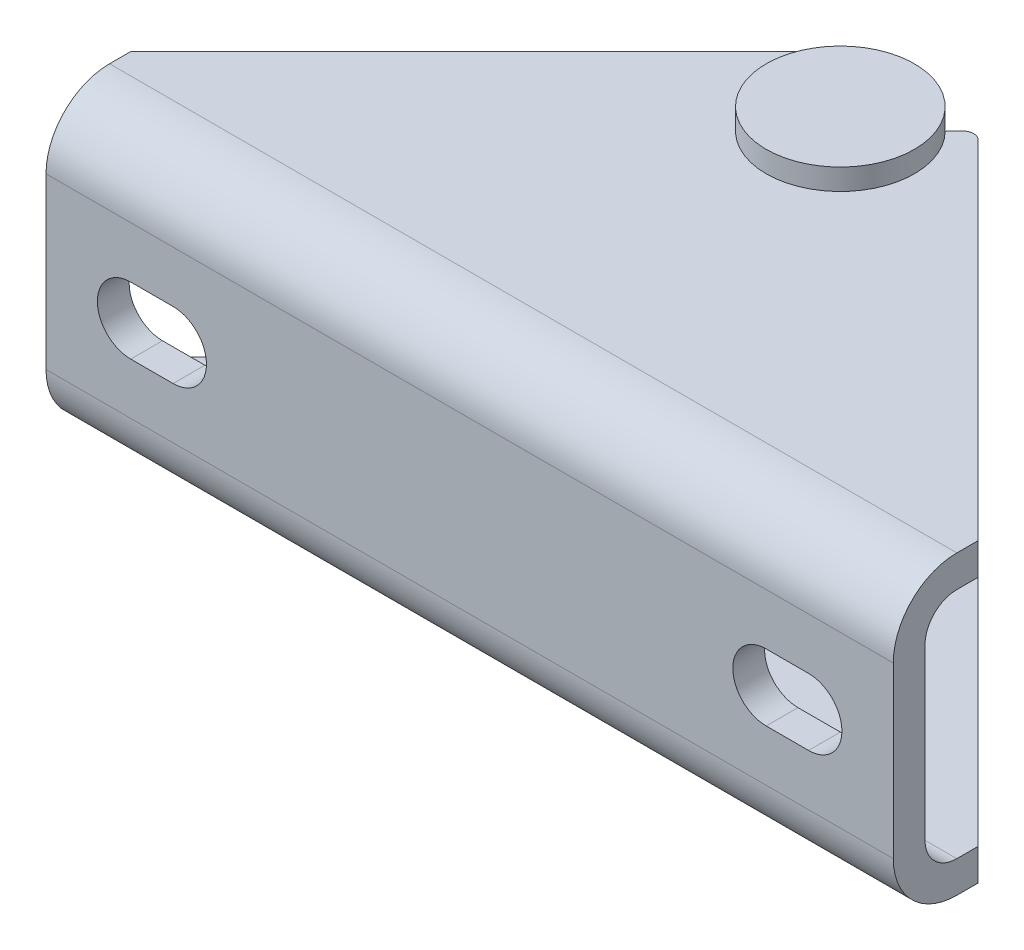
ISO-10303-21;
HEADER;
FILE_DESCRIPTION(('STEP AP214'),'2;1');
FILE_NAME('part.step','',(''),(''),'','','');
FILE_SCHEMA(('AUTOMOTIVE_DESIGN { 1 0 10303 214 1 1 1 1 }'));
ENDSEC;
DATA;
#1=APPLICATION_CONTEXT('core data for automotive mechanical design processes');
#2=APPLICATION_PROTOCOL_DEFINITION('international standard','automotive_design',2000,#1);
#3=PRODUCT_CONTEXT('',#1,'mechanical');
#4=PRODUCT('Part','Part','',(#3));
#5=PRODUCT_RELATED_PRODUCT_CATEGORY('part','',(#4));
#6=PRODUCT_DEFINITION_FORMATION('','',#4);
#7=PRODUCT_DEFINITION_CONTEXT('part definition',#1,'design');
#8=PRODUCT_DEFINITION('design','',#6,#7);
#9=PRODUCT_DEFINITION_SHAPE('','',#8);
#10=(LENGTH_UNIT() NAMED_UNIT(*) SI_UNIT(.MILLI.,.METRE.));
#11=(NAMED_UNIT(*) PLANE_ANGLE_UNIT() SI_UNIT($,.RADIAN.));
#12=(NAMED_UNIT(*) SI_UNIT($,.STERADIAN.) SOLID_ANGLE_UNIT());
#13=UNCERTAINTY_MEASURE_WITH_UNIT(LENGTH_MEASURE(1.E-05),#10,'distance_accuracy_value','');
#14=(GEOMETRIC_REPRESENTATION_CONTEXT(3) GLOBAL_UNCERTAINTY_ASSIGNED_CONTEXT((#13)) GLOBAL_UNIT_ASSIGNED_CONTEXT((#10,
#11,#12)) REPRESENTATION_CONTEXT('',''));
#15=CARTESIAN_POINT('',(0.,0.,0.));
#16=DIRECTION('',(0.,0.,1.));
#17=DIRECTION('',(1.,0.,0.));
#18=AXIS2_PLACEMENT_3D('',#15,#16,#17);
#19=CARTESIAN_POINT('',(32.0000000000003,5.,-35.));
#20=DIRECTION('',(0.,1.,0.));
#21=DIRECTION('',(-0.729035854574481,0.,0.684475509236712));
#22=AXIS2_PLACEMENT_3D('',#19,#20,#21);
#23=CYLINDRICAL_SURFACE('',#22,3.);
#24=CARTESIAN_POINT('',(32.0000000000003,-12.,-35.));
#25=DIRECTION('',(0.,-1.,0.));
#26=DIRECTION('',(0.99999998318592,0.,0.000183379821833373));
#27=AXIS2_PLACEMENT_3D('',#24,#25,#26);
#28=CIRCLE('',#27,3.);
#29=CARTESIAN_POINT('',(34.9999999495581,-12.,-34.9994498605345));
#30=VERTEX_POINT('',#29);
#31=EDGE_CURVE('E9',#30,#30,#28,.T.);
#32=ORIENTED_EDGE('',*,*,#31,.T.);
#33=EDGE_LOOP('',(#32));
#34=FACE_BOUND('',#33,.T.);
#35=CARTESIAN_POINT('',(32.0000000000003,-15.,-35.));
#36=DIRECTION('',(0.,1.,0.));
#37=DIRECTION('',(-0.729035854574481,0.,0.684475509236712));
#38=AXIS2_PLACEMENT_3D('',#35,#36,#37);
#39=CIRCLE('',#38,3.);
#40=CARTESIAN_POINT('',(29.8128924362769,-15.,-32.9465734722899));
#41=VERTEX_POINT('',#40);
#42=EDGE_CURVE('E607',#41,#41,#39,.T.);
#43=ORIENTED_EDGE('',*,*,#42,.T.);
#44=EDGE_LOOP('',(#43));
#45=FACE_BOUND('',#44,.T.);
#46=ADVANCED_FACE('F15',(#34,#45),#23,.T.);
#47=CARTESIAN_POINT('',(29.8128924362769,-15.,-32.9465734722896));
#48=DIRECTION('',(0.,1.,0.));
#49=DIRECTION('',(-0.729035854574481,0.,0.684475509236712));
#50=AXIS2_PLACEMENT_3D('',#47,#48,#49);
#51=PLANE('',#50);
#52=CARTESIAN_POINT('',(32.0000000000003,-15.,-35.));
#53=DIRECTION('',(0.,1.,0.));
#54=DIRECTION('',(-0.000183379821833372,0.,0.99999998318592));
#55=AXIS2_PLACEMENT_3D('',#52,#53,#54);
#56=CIRCLE('',#55,3.25);
#57=CARTESIAN_POINT('',(31.9994040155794,-15.,-31.7500000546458));
#58=VERTEX_POINT('',#57);
#59=EDGE_CURVE('E23',#58,#58,#56,.F.);
#60=ORIENTED_EDGE('',*,*,#59,.F.);
#61=EDGE_LOOP('',(#60));
#62=FACE_BOUND('',#61,.T.);
#63=ORIENTED_EDGE('',*,*,#42,.F.);
#64=EDGE_LOOP('',(#63));
#65=FACE_BOUND('',#64,.T.);
#66=ADVANCED_FACE('F626',(#62,#65),#51,.T.);
#67=CARTESIAN_POINT('',(27.6257848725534,-19.,-30.8931469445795));
#68=DIRECTION('',(0.,-1.,0.));
#69=DIRECTION('',(0.729035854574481,0.,-0.684475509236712));
#70=AXIS2_PLACEMENT_3D('',#67,#68,#69);
#71=PLANE('',#70);
#72=CARTESIAN_POINT('',(32.0000000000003,-19.,-35.));
#73=DIRECTION('',(0.,-1.,0.));
#74=DIRECTION('',(0.729035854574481,0.,-0.684475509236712));
#75=AXIS2_PLACEMENT_3D('',#72,#73,#74);
#76=CIRCLE('',#75,2.5);
#77=CARTESIAN_POINT('',(33.8225896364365,-19.,-36.7111887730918));
#78=VERTEX_POINT('',#77);
#79=EDGE_CURVE('E616',#78,#78,#76,.T.);
#80=ORIENTED_EDGE('',*,*,#79,.T.);
#81=EDGE_LOOP('',(#80));
#82=FACE_BOUND('',#81,.T.);
#83=ADVANCED_FACE('F629',(#82),#71,.T.);
#84=CARTESIAN_POINT('',(32.0000000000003,5.,-35.));
#85=DIRECTION('',(0.,1.,0.));
#86=DIRECTION('',(-0.729035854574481,0.,0.684475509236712));
#87=AXIS2_PLACEMENT_3D('',#84,#85,#86);
#88=CYLINDRICAL_SURFACE('',#87,6.);
#89=CARTESIAN_POINT('',(32.0000000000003,-15.5,-35.));
#90=DIRECTION('',(0.,-1.,0.));
#91=DIRECTION('',(0.729035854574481,0.,-0.684475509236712));
#92=AXIS2_PLACEMENT_3D('',#89,#90,#91);
#93=CIRCLE('',#92,6.);
#94=CARTESIAN_POINT('',(36.3742151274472,-15.5,-39.1068530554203));
#95=VERTEX_POINT('',#94);
#96=EDGE_CURVE('E613',#95,#95,#93,.F.);
#97=ORIENTED_EDGE('',*,*,#96,.T.);
#98=EDGE_LOOP('',(#97));
#99=FACE_BOUND('',#98,.T.);
#100=CARTESIAN_POINT('',(32.0000000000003,-15.,-35.));
#101=DIRECTION('',(0.,1.,0.));
#102=DIRECTION('',(-0.729035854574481,0.,0.684475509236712));
#103=AXIS2_PLACEMENT_3D('',#100,#101,#102);
#104=CIRCLE('',#103,6.);
#105=CARTESIAN_POINT('',(27.6257848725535,-15.,-30.8931469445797));
#106=VERTEX_POINT('',#105);
#107=EDGE_CURVE('E610',#106,#106,#104,.T.);
#108=ORIENTED_EDGE('',*,*,#107,.F.);
#109=EDGE_LOOP('',(#108));
#110=FACE_BOUND('',#109,.T.);
#111=ADVANCED_FACE('F763',(#99,#110),#88,.T.);
#112=CARTESIAN_POINT('',(32.0000000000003,-15.5,-35.));
#113=DIRECTION('',(0.,-1.,0.));
#114=DIRECTION('',(0.729035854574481,0.,-0.684475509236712));
#115=AXIS2_PLACEMENT_3D('',#112,#113,#114);
#116=DEGENERATE_TOROIDAL_SURFACE('',#115,2.5,3.5,.T.);
#117=ORIENTED_EDGE('',*,*,#79,.F.);
#118=EDGE_LOOP('',(#117));
#119=FACE_BOUND('',#118,.T.);
#120=ORIENTED_EDGE('',*,*,#96,.F.);
#121=EDGE_LOOP('',(#120));
#122=FACE_BOUND('',#121,.T.);
#123=ADVANCED_FACE('F761',(#119,#122),#116,.T.);
#124=CARTESIAN_POINT('',(4.0000000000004,0.,-41.08578644));
#125=DIRECTION('',(0.,0.,1.));
#126=DIRECTION('',(0.,1.,0.));
#127=AXIS2_PLACEMENT_3D('',#124,#125,#126);
#128=CYLINDRICAL_SURFACE('',#127,3.15);
#129=CARTESIAN_POINT('',(4.00000000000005,0.,-3.));
#130=DIRECTION('',(0.,0.,1.));
#131=DIRECTION('',(0.,1.,0.));
#132=AXIS2_PLACEMENT_3D('',#129,#130,#131);
#133=CIRCLE('',#132,3.15);
#134=CARTESIAN_POINT('',(4.00000000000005,3.15,-3.));
#135=VERTEX_POINT('',#134);
#136=CARTESIAN_POINT('',(4.,-3.15000000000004,-3.));
#137=VERTEX_POINT('',#136);
#138=EDGE_CURVE('E538',#135,#137,#133,.F.);
#139=ORIENTED_EDGE('',*,*,#138,.T.);
#140=DIRECTION('',(0.,0.,1.));
#141=VECTOR('',#140,1.);
#142=CARTESIAN_POINT('',(4.00000000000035,-3.15,-41.08578644));
#143=LINE('',#142,#141);
#144=CARTESIAN_POINT('',(4.,-3.15,0.));
#145=VERTEX_POINT('',#144);
#146=EDGE_CURVE('E329',#137,#145,#143,.T.);
#147=ORIENTED_EDGE('',*,*,#146,.T.);
#148=CARTESIAN_POINT('',(4.,0.,0.));
#149=DIRECTION('',(0.,0.,-1.));
#150=DIRECTION('',(0.,-1.,0.));
#151=AXIS2_PLACEMENT_3D('',#148,#149,#150);
#152=CIRCLE('',#151,3.15);
#153=CARTESIAN_POINT('',(4.00000000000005,3.15,0.));
#154=VERTEX_POINT('',#153);
#155=EDGE_CURVE('E312',#154,#145,#152,.T.);
#156=ORIENTED_EDGE('',*,*,#155,.F.);
#157=DIRECTION('',(0.,0.,1.));
#158=VECTOR('',#157,1.);
#159=CARTESIAN_POINT('',(4.0000000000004,3.15,-41.08578644));
#160=LINE('',#159,#158);
#161=EDGE_CURVE('E303',#135,#154,#160,.T.);
#162=ORIENTED_EDGE('',*,*,#161,.F.);
#163=EDGE_LOOP('',(#139,#147,#156,#162));
#164=FACE_BOUND('',#163,.T.);
#165=ADVANCED_FACE('F740',(#164),#128,.F.);
#166=CARTESIAN_POINT('',(4.0000000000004,3.15,-41.08578644));
#167=DIRECTION('',(0.,-1.,0.));
#168=DIRECTION('',(-1.,0.,0.));
#169=AXIS2_PLACEMENT_3D('',#166,#167,#168);
#170=PLANE('',#169);
#171=DIRECTION('',(1.,0.,0.));
#172=VECTOR('',#171,1.);
#173=CARTESIAN_POINT('',(72.,3.14999999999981,-2.99999999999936));
#174=LINE('',#173,#172);
#175=CARTESIAN_POINT('',(0.,3.15,-3.));
#176=VERTEX_POINT('',#175);
#177=EDGE_CURVE('E541',#176,#135,#174,.T.);
#178=ORIENTED_EDGE('',*,*,#177,.T.);
#179=ORIENTED_EDGE('',*,*,#161,.T.);
#180=DIRECTION('',(1.,0.,0.));
#181=VECTOR('',#180,1.);
#182=CARTESIAN_POINT('',(4.00000000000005,3.15,0.));
#183=LINE('',#182,#181);
#184=CARTESIAN_POINT('',(0.,3.15,0.));
#185=VERTEX_POINT('',#184);
#186=EDGE_CURVE('E306',#185,#154,#183,.T.);
#187=ORIENTED_EDGE('',*,*,#186,.F.);
#188=DIRECTION('',(0.,0.,1.));
#189=VECTOR('',#188,1.);
#190=CARTESIAN_POINT('',(3.67761376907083E-13,3.15,-41.08578644));
#191=LINE('',#190,#189);
#192=EDGE_CURVE('E291',#176,#185,#191,.T.);
#193=ORIENTED_EDGE('',*,*,#192,.F.);
#194=EDGE_LOOP('',(#178,#179,#187,#193));
#195=FACE_BOUND('',#194,.T.);
#196=ADVANCED_FACE('F307',(#195),#170,.T.);
#197=CARTESIAN_POINT('',(3.67761376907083E-13,0.,-41.08578644));
#198=DIRECTION('',(0.,0.,1.));
#199=DIRECTION('',(0.,1.,0.));
#200=AXIS2_PLACEMENT_3D('',#197,#198,#199);
#201=CYLINDRICAL_SURFACE('',#200,3.15);
#202=CARTESIAN_POINT('',(0.,0.,-3.));
#203=DIRECTION('',(0.,0.,1.));
#204=DIRECTION('',(0.,1.,0.));
#205=AXIS2_PLACEMENT_3D('',#202,#203,#204);
#206=CIRCLE('',#205,3.15);
#207=CARTESIAN_POINT('',(0.,-3.15,-3.));
#208=VERTEX_POINT('',#207);
#209=EDGE_CURVE('E299',#208,#176,#206,.F.);
#210=ORIENTED_EDGE('',*,*,#209,.T.);
#211=ORIENTED_EDGE('',*,*,#192,.T.);
#212=CARTESIAN_POINT('',(0.,0.,0.));
#213=DIRECTION('',(0.,0.,-1.));
#214=DIRECTION('',(0.,1.,0.));
#215=AXIS2_PLACEMENT_3D('',#212,#213,#214);
#216=CIRCLE('',#215,3.15);
#217=CARTESIAN_POINT('',(0.,-3.15,0.));
#218=VERTEX_POINT('',#217);
#219=EDGE_CURVE('E296',#218,#185,#216,.T.);
#220=ORIENTED_EDGE('',*,*,#219,.F.);
#221=DIRECTION('',(0.,0.,1.));
#222=VECTOR('',#221,1.);
#223=CARTESIAN_POINT('',(3.67761376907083E-13,-3.15,-41.08578644));
#224=LINE('',#223,#222);
#225=EDGE_CURVE('E327',#208,#218,#224,.T.);
#226=ORIENTED_EDGE('',*,*,#225,.F.);
#227=EDGE_LOOP('',(#210,#211,#220,#226));
#228=FACE_BOUND('',#227,.T.);
#229=ADVANCED_FACE('F293',(#228),#201,.F.);
#230=CARTESIAN_POINT('',(4.00000000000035,-3.15000000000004,-41.08578644));
#231=DIRECTION('',(0.,1.,0.));
#232=DIRECTION('',(1.,0.,0.));
#233=AXIS2_PLACEMENT_3D('',#230,#231,#232);
#234=PLANE('',#233);
#235=DIRECTION('',(-1.,0.,0.));
#236=VECTOR('',#235,1.);
#237=CARTESIAN_POINT('',(72.,-3.15000000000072,-2.99999999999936));
#238=LINE('',#237,#236);
#239=EDGE_CURVE('E536',#137,#208,#238,.T.);
#240=ORIENTED_EDGE('',*,*,#239,.T.);
#241=ORIENTED_EDGE('',*,*,#225,.T.);
#242=DIRECTION('',(-1.,0.,0.));
#243=VECTOR('',#242,1.);
#244=CARTESIAN_POINT('',(4.,-3.15000000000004,0.));
#245=LINE('',#244,#243);
#246=EDGE_CURVE('E317',#145,#218,#245,.T.);
#247=ORIENTED_EDGE('',*,*,#246,.F.);
#248=ORIENTED_EDGE('',*,*,#146,.F.);
#249=EDGE_LOOP('',(#240,#241,#247,#248));
#250=FACE_BOUND('',#249,.T.);
#251=ADVANCED_FACE('F817',(#250),#234,.T.);
#252=CARTESIAN_POINT('',(64.,0.,-41.0857864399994));
#253=DIRECTION('',(0.,0.,1.));
#254=DIRECTION('',(0.,1.,0.));
#255=AXIS2_PLACEMENT_3D('',#252,#253,#254);
#256=CYLINDRICAL_SURFACE('',#255,3.15);
#257=CARTESIAN_POINT('',(64.,0.,-2.99999999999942));
#258=DIRECTION('',(0.,0.,1.));
#259=DIRECTION('',(0.,1.,0.));
#260=AXIS2_PLACEMENT_3D('',#257,#258,#259);
#261=CIRCLE('',#260,3.15);
#262=CARTESIAN_POINT('',(64.,3.14999999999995,-2.99999999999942));
#263=VERTEX_POINT('',#262);
#264=CARTESIAN_POINT('',(64.,-3.15000000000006,-2.99999999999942));
#265=VERTEX_POINT('',#264);
#266=EDGE_CURVE('E529',#263,#265,#261,.F.);
#267=ORIENTED_EDGE('',*,*,#266,.T.);
#268=DIRECTION('',(0.,0.,1.));
#269=VECTOR('',#268,1.);
#270=CARTESIAN_POINT('',(64.,-3.15,-41.0857864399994));
#271=LINE('',#270,#269);
#272=CARTESIAN_POINT('',(64.,-3.15,5.68989300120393E-13));
#273=VERTEX_POINT('',#272);
#274=EDGE_CURVE('E346',#265,#273,#271,.T.);
#275=ORIENTED_EDGE('',*,*,#274,.T.);
#276=CARTESIAN_POINT('',(64.,0.,5.68989300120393E-13));
#277=DIRECTION('',(0.,0.,-1.));
#278=DIRECTION('',(0.,-1.,0.));
#279=AXIS2_PLACEMENT_3D('',#276,#277,#278);
#280=CIRCLE('',#279,3.15);
#281=CARTESIAN_POINT('',(64.,3.14999999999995,5.68989300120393E-13));
#282=VERTEX_POINT('',#281);
#283=EDGE_CURVE('E337',#282,#273,#280,.T.);
#284=ORIENTED_EDGE('',*,*,#283,.F.);
#285=DIRECTION('',(0.,0.,1.));
#286=VECTOR('',#285,1.);
#287=CARTESIAN_POINT('',(64.,3.14999999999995,-41.0857864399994));
#288=LINE('',#287,#286);
#289=EDGE_CURVE('E348',#263,#282,#288,.T.);
#290=ORIENTED_EDGE('',*,*,#289,.F.);
#291=EDGE_LOOP('',(#267,#275,#284,#290));
#292=FACE_BOUND('',#291,.T.);
#293=ADVANCED_FACE('F825',(#292),#256,.F.);
#294=CARTESIAN_POINT('',(64.,3.14999999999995,-41.0857864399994));
#295=DIRECTION('',(0.,-1.,0.));
#296=DIRECTION('',(-1.,0.,0.));
#297=AXIS2_PLACEMENT_3D('',#294,#295,#296);
#298=PLANE('',#297);
#299=DIRECTION('',(1.,0.,0.));
#300=VECTOR('',#299,1.);
#301=CARTESIAN_POINT('',(72.,3.14999999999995,-2.99999999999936));
#302=LINE('',#301,#300);
#303=CARTESIAN_POINT('',(60.,3.14999999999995,-2.99999999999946));
#304=VERTEX_POINT('',#303);
#305=EDGE_CURVE('E532',#304,#263,#302,.T.);
#306=ORIENTED_EDGE('',*,*,#305,.T.);
#307=ORIENTED_EDGE('',*,*,#289,.T.);
#308=DIRECTION('',(1.,0.,0.));
#309=VECTOR('',#308,1.);
#310=CARTESIAN_POINT('',(64.,3.14999999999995,5.68989300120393E-13));
#311=LINE('',#310,#309);
#312=CARTESIAN_POINT('',(60.,3.14999999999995,5.41233724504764E-13));
#313=VERTEX_POINT('',#312);
#314=EDGE_CURVE('E334',#313,#282,#311,.T.);
#315=ORIENTED_EDGE('',*,*,#314,.F.);
#316=DIRECTION('',(0.,0.,1.));
#317=VECTOR('',#316,1.);
#318=CARTESIAN_POINT('',(60.,3.14999999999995,-41.0857864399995));
#319=LINE('',#318,#317);
#320=EDGE_CURVE('E350',#304,#313,#319,.T.);
#321=ORIENTED_EDGE('',*,*,#320,.F.);
#322=EDGE_LOOP('',(#306,#307,#315,#321));
#323=FACE_BOUND('',#322,.T.);
#324=ADVANCED_FACE('F834',(#323),#298,.T.);
#325=CARTESIAN_POINT('',(60.,0.,-41.0857864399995));
#326=DIRECTION('',(0.,0.,1.));
#327=DIRECTION('',(0.,1.,0.));
#328=AXIS2_PLACEMENT_3D('',#325,#326,#327);
#329=CYLINDRICAL_SURFACE('',#328,3.15);
#330=CARTESIAN_POINT('',(60.,0.,-2.99999999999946));
#331=DIRECTION('',(0.,0.,1.));
#332=DIRECTION('',(0.,1.,0.));
#333=AXIS2_PLACEMENT_3D('',#330,#331,#332);
#334=CIRCLE('',#333,3.15);
#335=CARTESIAN_POINT('',(60.,-3.15000000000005,-2.99999999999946));
#336=VERTEX_POINT('',#335);
#337=EDGE_CURVE('E534',#336,#304,#334,.F.);
#338=ORIENTED_EDGE('',*,*,#337,.T.);
#339=ORIENTED_EDGE('',*,*,#320,.T.);
#340=CARTESIAN_POINT('',(60.,0.,5.41233724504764E-13));
#341=DIRECTION('',(0.,0.,-1.));
#342=DIRECTION('',(0.,1.,0.));
#343=AXIS2_PLACEMENT_3D('',#340,#341,#342);
#344=CIRCLE('',#343,3.15);
#345=CARTESIAN_POINT('',(60.,-3.15000000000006,5.41233724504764E-13));
#346=VERTEX_POINT('',#345);
#347=EDGE_CURVE('E302',#346,#313,#344,.T.);
#348=ORIENTED_EDGE('',*,*,#347,.F.);
#349=DIRECTION('',(0.,0.,1.));
#350=VECTOR('',#349,1.);
#351=CARTESIAN_POINT('',(60.,-3.15000000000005,-41.0857864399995));
#352=LINE('',#351,#350);
#353=EDGE_CURVE('E343',#336,#346,#352,.T.);
#354=ORIENTED_EDGE('',*,*,#353,.F.);
#355=EDGE_LOOP('',(#338,#339,#348,#354));
#356=FACE_BOUND('',#355,.T.);
#357=ADVANCED_FACE('F700',(#356),#329,.F.);
#358=CARTESIAN_POINT('',(64.,-3.15000000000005,-41.0857864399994));
#359=DIRECTION('',(0.,1.,0.));
#360=DIRECTION('',(1.,0.,0.));
#361=AXIS2_PLACEMENT_3D('',#358,#359,#360);
#362=PLANE('',#361);
#363=DIRECTION('',(-1.,0.,0.));
#364=VECTOR('',#363,1.);
#365=CARTESIAN_POINT('',(72.,-3.15000000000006,-2.99999999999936));
#366=LINE('',#365,#364);
#367=EDGE_CURVE('E527',#265,#336,#366,.T.);
#368=ORIENTED_EDGE('',*,*,#367,.T.);
#369=ORIENTED_EDGE('',*,*,#353,.T.);
#370=DIRECTION('',(-1.,0.,0.));
#371=VECTOR('',#370,1.);
#372=CARTESIAN_POINT('',(64.,-3.15000000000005,5.68989300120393E-13));
#373=LINE('',#372,#371);
#374=EDGE_CURVE('E340',#273,#346,#373,.T.);
#375=ORIENTED_EDGE('',*,*,#374,.F.);
#376=ORIENTED_EDGE('',*,*,#274,.F.);
#377=EDGE_LOOP('',(#368,#369,#375,#376));
#378=FACE_BOUND('',#377,.T.);
#379=ADVANCED_FACE('F687',(#378),#362,.T.);
#380=CARTESIAN_POINT('',(32.0000000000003,-4.,-35.));
#381=DIRECTION('',(0.,-1.,0.));
#382=DIRECTION('',(0.963329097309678,0.,0.268322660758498));
#383=AXIS2_PLACEMENT_3D('',#380,#381,#382);
#384=PLANE('',#383);
#385=CARTESIAN_POINT('',(32.0000000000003,-4.,-35.));
#386=DIRECTION('',(0.,-1.,0.));
#387=DIRECTION('',(0.963329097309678,0.,0.268322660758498));
#388=AXIS2_PLACEMENT_3D('',#385,#386,#387);
#389=CIRCLE('',#388,8.);
#390=CARTESIAN_POINT('',(39.7066327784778,-4.,-32.853418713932));
#391=VERTEX_POINT('',#390);
#392=EDGE_CURVE('E601',#391,#391,#389,.T.);
#393=ORIENTED_EDGE('',*,*,#392,.F.);
#394=EDGE_LOOP('',(#393));
#395=FACE_BOUND('',#394,.T.);
#396=CARTESIAN_POINT('',(32.0000000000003,-4.,-35.));
#397=DIRECTION('',(0.,-1.,0.));
#398=DIRECTION('',(0.963329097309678,0.,0.268322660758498));
#399=AXIS2_PLACEMENT_3D('',#396,#397,#398);
#400=CIRCLE('',#399,5.25);
#401=CARTESIAN_POINT('',(37.0574777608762,-4.,-33.5913060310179));
#402=VERTEX_POINT('',#401);
#403=EDGE_CURVE('E594',#402,#402,#400,.T.);
#404=ORIENTED_EDGE('',*,*,#403,.T.);
#405=EDGE_LOOP('',(#404));
#406=FACE_BOUND('',#405,.T.);
#407=ADVANCED_FACE('F672',(#395,#406),#384,.F.);
#408=CARTESIAN_POINT('',(32.0000000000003,4.,-35.));
#409=DIRECTION('',(0.,-1.,0.));
#410=DIRECTION('',(0.999241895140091,0.,-0.0389311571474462));
#411=AXIS2_PLACEMENT_3D('',#408,#409,#410);
#412=PLANE('',#411);
#413=CARTESIAN_POINT('',(32.0000000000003,4.,-35.));
#414=DIRECTION('',(0.,-1.,0.));
#415=DIRECTION('',(0.999241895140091,0.,-0.0389311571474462));
#416=AXIS2_PLACEMENT_3D('',#413,#414,#415);
#417=CIRCLE('',#416,8.);
#418=CARTESIAN_POINT('',(39.9939351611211,4.,-35.3114492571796));
#419=VERTEX_POINT('',#418);
#420=EDGE_CURVE('E1341',#419,#419,#417,.T.);
#421=ORIENTED_EDGE('',*,*,#420,.T.);
#422=EDGE_LOOP('',(#421));
#423=FACE_BOUND('',#422,.T.);
#424=CARTESIAN_POINT('',(32.0000000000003,4.,-35.));
#425=DIRECTION('',(0.,-1.,0.));
#426=DIRECTION('',(0.999241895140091,0.,-0.0389311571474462));
#427=AXIS2_PLACEMENT_3D('',#424,#425,#426);
#428=CIRCLE('',#427,5.25);
#429=CARTESIAN_POINT('',(37.2460199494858,4.,-35.2043885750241));
#430=VERTEX_POINT('',#429);
#431=EDGE_CURVE('E1330',#430,#430,#428,.T.);
#432=ORIENTED_EDGE('',*,*,#431,.F.);
#433=EDGE_LOOP('',(#432));
#434=FACE_BOUND('',#433,.T.);
#435=ADVANCED_FACE('F686',(#423,#434),#412,.T.);
#436=CARTESIAN_POINT('',(32.0000000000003,4.,-35.));
#437=DIRECTION('',(0.,1.,0.));
#438=DIRECTION('',(-0.999241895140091,0.,0.0389311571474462));
#439=AXIS2_PLACEMENT_3D('',#436,#437,#438);
#440=CYLINDRICAL_SURFACE('',#439,8.);
#441=ORIENTED_EDGE('',*,*,#420,.F.);
#442=EDGE_LOOP('',(#441));
#443=FACE_BOUND('',#442,.T.);
#444=CARTESIAN_POINT('',(32.0000000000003,11.,-35.));
#445=DIRECTION('',(0.,-1.,0.));
#446=DIRECTION('',(0.999241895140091,0.,-0.0389311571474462));
#447=AXIS2_PLACEMENT_3D('',#444,#445,#446);
#448=CIRCLE('',#447,8.);
#449=CARTESIAN_POINT('',(26.3431457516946,11.,-40.6568542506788));
#450=VERTEX_POINT('',#449);
#451=CARTESIAN_POINT('',(37.6568542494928,11.,-40.656854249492));
#452=VERTEX_POINT('',#451);
#453=EDGE_CURVE('E1338',#450,#452,#448,.T.);
#454=ORIENTED_EDGE('',*,*,#453,.T.);
#455=CARTESIAN_POINT('',(32.0000000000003,11.,-35.));
#456=DIRECTION('',(0.,1.,0.));
#457=DIRECTION('',(-0.99999998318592,0.,-0.000183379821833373));
#458=AXIS2_PLACEMENT_3D('',#455,#456,#457);
#459=CIRCLE('',#458,8.);
#460=EDGE_CURVE('E582',#452,#450,#459,.F.);
#461=ORIENTED_EDGE('',*,*,#460,.T.);
#462=EDGE_LOOP('',(#454,#461));
#463=FACE_BOUND('',#462,.T.);
#464=ADVANCED_FACE('F696',(#443,#463),#440,.T.);
#465=CARTESIAN_POINT('',(38.4999999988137,14.,-40.0857864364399));
#466=DIRECTION('',(0.,-1.,0.));
#467=DIRECTION('',(-1.,0.,0.));
#468=AXIS2_PLACEMENT_3D('',#465,#466,#467);
#469=CYLINDRICAL_SURFACE('',#468,1.);
#470=CARTESIAN_POINT('',(38.4999999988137,11.,-40.0857864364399));
#471=DIRECTION('',(0.,1.,0.));
#472=DIRECTION('',(1.,0.,0.));
#473=AXIS2_PLACEMENT_3D('',#470,#471,#472);
#474=CIRCLE('',#473,1.);
#475=CARTESIAN_POINT('',(37.7928932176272,11.,-40.7928932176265));
#476=VERTEX_POINT('',#475);
#477=CARTESIAN_POINT('',(39.2071067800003,11.,-40.7928932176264));
#478=VERTEX_POINT('',#477);
#479=EDGE_CURVE('E388',#476,#478,#474,.F.);
#480=ORIENTED_EDGE('',*,*,#479,.F.);
#481=DIRECTION('',(0.,-1.,0.));
#482=VECTOR('',#481,1.);
#483=CARTESIAN_POINT('',(37.7928932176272,14.,-40.7928932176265));
#484=LINE('',#483,#482);
#485=CARTESIAN_POINT('',(37.7928932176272,14.,-40.7928932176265));
#486=VERTEX_POINT('',#485);
#487=EDGE_CURVE('E485',#486,#476,#484,.T.);
#488=ORIENTED_EDGE('',*,*,#487,.F.);
#489=CARTESIAN_POINT('',(38.4999999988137,14.,-40.0857864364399));
#490=DIRECTION('',(0.,-1.,0.));
#491=DIRECTION('',(1.,0.,0.));
#492=AXIS2_PLACEMENT_3D('',#489,#490,#491);
#493=CIRCLE('',#492,1.);
#494=CARTESIAN_POINT('',(39.2071067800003,14.,-40.7928932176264));
#495=VERTEX_POINT('',#494);
#496=EDGE_CURVE('E476',#486,#495,#493,.T.);
#497=ORIENTED_EDGE('',*,*,#496,.T.);
#498=DIRECTION('',(0.,-1.,0.));
#499=VECTOR('',#498,1.);
#500=CARTESIAN_POINT('',(39.2071067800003,14.,-40.7928932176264));
#501=LINE('',#500,#499);
#502=EDGE_CURVE('E480',#495,#478,#501,.T.);
#503=ORIENTED_EDGE('',*,*,#502,.T.);
#504=EDGE_LOOP('',(#480,#488,#497,#503));
#505=FACE_BOUND('',#504,.T.);
#506=ADVANCED_FACE('F966',(#505),#469,.T.);
#507=CARTESIAN_POINT('',(25.5000000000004,14.,-40.0857864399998));
#508=DIRECTION('',(0.,-1.,0.));
#509=DIRECTION('',(-1.,0.,0.));
#510=AXIS2_PLACEMENT_3D('',#507,#508,#509);
#511=CYLINDRICAL_SURFACE('',#510,1.);
#512=CARTESIAN_POINT('',(25.5000000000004,11.,-40.0857864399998));
#513=DIRECTION('',(0.,1.,0.));
#514=DIRECTION('',(1.,0.,0.));
#515=AXIS2_PLACEMENT_3D('',#512,#513,#514);
#516=CIRCLE('',#515,1.);
#517=CARTESIAN_POINT('',(24.7928932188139,11.,-40.7928932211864));
#518=VERTEX_POINT('',#517);
#519=CARTESIAN_POINT('',(26.207106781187,11.,-40.7928932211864));
#520=VERTEX_POINT('',#519);
#521=EDGE_CURVE('E367',#518,#520,#516,.F.);
#522=ORIENTED_EDGE('',*,*,#521,.F.);
#523=DIRECTION('',(0.,-1.,0.));
#524=VECTOR('',#523,1.);
#525=CARTESIAN_POINT('',(24.7928932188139,14.,-40.7928932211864));
#526=LINE('',#525,#524);
#527=CARTESIAN_POINT('',(24.7928932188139,14.,-40.7928932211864));
#528=VERTEX_POINT('',#527);
#529=EDGE_CURVE('E509',#528,#518,#526,.T.);
#530=ORIENTED_EDGE('',*,*,#529,.F.);
#531=CARTESIAN_POINT('',(25.5000000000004,14.,-40.0857864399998));
#532=DIRECTION('',(0.,-1.,0.));
#533=DIRECTION('',(-1.,0.,0.));
#534=AXIS2_PLACEMENT_3D('',#531,#532,#533);
#535=CIRCLE('',#534,1.);
#536=CARTESIAN_POINT('',(26.207106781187,14.,-40.7928932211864));
#537=VERTEX_POINT('',#536);
#538=EDGE_CURVE('E460',#528,#537,#535,.T.);
#539=ORIENTED_EDGE('',*,*,#538,.T.);
#540=DIRECTION('',(0.,-1.,0.));
#541=VECTOR('',#540,1.);
#542=CARTESIAN_POINT('',(26.207106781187,14.,-40.7928932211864));
#543=LINE('',#542,#541);
#544=EDGE_CURVE('E505',#537,#520,#543,.T.);
#545=ORIENTED_EDGE('',*,*,#544,.T.);
#546=EDGE_LOOP('',(#522,#530,#539,#545));
#547=FACE_BOUND('',#546,.T.);
#548=ADVANCED_FACE('F736',(#547),#511,.T.);
#549=CARTESIAN_POINT('',(32.0000000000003,16.,-35.));
#550=DIRECTION('',(0.,-1.,0.));
#551=DIRECTION('',(0.99999998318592,0.,0.000183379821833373));
#552=AXIS2_PLACEMENT_3D('',#549,#550,#551);
#553=PLANE('',#552);
#554=CARTESIAN_POINT('',(32.0000000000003,16.,-35.));
#555=DIRECTION('',(0.,-1.,0.));
#556=DIRECTION('',(0.99999998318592,0.,0.000183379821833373));
#557=AXIS2_PLACEMENT_3D('',#554,#555,#556);
#558=CIRCLE('',#557,7.);
#559=CARTESIAN_POINT('',(38.9999998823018,16.,-34.9987163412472));
#560=VERTEX_POINT('',#559);
#561=EDGE_CURVE('E1327',#560,#560,#558,.T.);
#562=ORIENTED_EDGE('',*,*,#561,.F.);
#563=EDGE_LOOP('',(#562));
#564=FACE_BOUND('',#563,.T.);
#565=ADVANCED_FACE('F982',(#564),#553,.F.);
#566=CARTESIAN_POINT('',(-8.00000000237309,14.,-8.00000000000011));
#567=DIRECTION('',(-0.70710678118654,0.,-0.707106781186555));
#568=DIRECTION('',(0.707106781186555,0.,-0.70710678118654));
#569=AXIS2_PLACEMENT_3D('',#566,#567,#568);
#570=PLANE('',#569);
#571=DIRECTION('',(0.707106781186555,0.,-0.70710678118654));
#572=VECTOR('',#571,1.);
#573=CARTESIAN_POINT('',(-8.00000000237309,11.,-8.00000000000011));
#574=LINE('',#573,#572);
#575=CARTESIAN_POINT('',(-7.99999999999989,11.,-8.));
#576=VERTEX_POINT('',#575);
#577=EDGE_CURVE('E365',#576,#518,#574,.T.);
#578=ORIENTED_EDGE('',*,*,#577,.F.);
#579=DIRECTION('',(0.,-1.,0.));
#580=VECTOR('',#579,1.);
#581=CARTESIAN_POINT('',(-8.00000000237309,14.,-8.00000000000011));
#582=LINE('',#581,#580);
#583=CARTESIAN_POINT('',(-8.00000000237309,14.,-8.00000000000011));
#584=VERTEX_POINT('',#583);
#585=EDGE_CURVE('E513',#584,#576,#582,.T.);
#586=ORIENTED_EDGE('',*,*,#585,.F.);
#587=DIRECTION('',(0.707106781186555,0.,-0.70710678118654));
#588=VECTOR('',#587,1.);
#589=CARTESIAN_POINT('',(-8.00000000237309,14.,-8.00000000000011));
#590=LINE('',#589,#588);
#591=EDGE_CURVE('E457',#584,#528,#590,.T.);
#592=ORIENTED_EDGE('',*,*,#591,.T.);
#593=ORIENTED_EDGE('',*,*,#529,.T.);
#594=EDGE_LOOP('',(#578,#586,#592,#593));
#595=FACE_BOUND('',#594,.T.);
#596=ADVANCED_FACE('F985',(#595),#570,.T.);
#597=CARTESIAN_POINT('',(71.9999999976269,14.,-7.99999999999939));
#598=DIRECTION('',(0.707106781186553,0.,-0.707106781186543));
#599=DIRECTION('',(0.707106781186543,0.,0.707106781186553));
#600=AXIS2_PLACEMENT_3D('',#597,#598,#599);
#601=PLANE('',#600);
#602=DIRECTION('',(0.707106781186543,0.,0.707106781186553));
#603=VECTOR('',#602,1.);
#604=CARTESIAN_POINT('',(71.9999999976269,11.,-7.99999999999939));
#605=LINE('',#604,#603);
#606=CARTESIAN_POINT('',(72.,11.,-7.99999999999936));
#607=VERTEX_POINT('',#606);
#608=EDGE_CURVE('E390',#478,#607,#605,.T.);
#609=ORIENTED_EDGE('',*,*,#608,.F.);
#610=ORIENTED_EDGE('',*,*,#502,.F.);
#611=DIRECTION('',(0.707106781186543,0.,0.707106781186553));
#612=VECTOR('',#611,1.);
#613=CARTESIAN_POINT('',(71.9999999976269,14.,-7.99999999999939));
#614=LINE('',#613,#612);
#615=CARTESIAN_POINT('',(71.9999999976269,14.,-7.99999999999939));
#616=VERTEX_POINT('',#615);
#617=EDGE_CURVE('E449',#495,#616,#614,.T.);
#618=ORIENTED_EDGE('',*,*,#617,.T.);
#619=DIRECTION('',(0.,-1.,0.));
#620=VECTOR('',#619,1.);
#621=CARTESIAN_POINT('',(71.9999999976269,14.,-7.99999999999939));
#622=LINE('',#621,#620);
#623=EDGE_CURVE('E523',#616,#607,#622,.T.);
#624=ORIENTED_EDGE('',*,*,#623,.T.);
#625=EDGE_LOOP('',(#609,#610,#618,#624));
#626=FACE_BOUND('',#625,.T.);
#627=ADVANCED_FACE('F976',(#626),#601,.T.);
#628=CARTESIAN_POINT('',(72.,11.,-51.7428843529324));
#629=DIRECTION('',(0.,1.,0.));
#630=DIRECTION('',(1.,0.,0.));
#631=AXIS2_PLACEMENT_3D('',#628,#629,#630);
#632=PLANE('',#631);
#633=ORIENTED_EDGE('',*,*,#460,.F.);
#634=DIRECTION('',(0.707106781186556,0.,-0.70710678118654));
#635=VECTOR('',#634,1.);
#636=CARTESIAN_POINT('',(37.,11.,-40.));
#637=LINE('',#636,#635);
#638=EDGE_CURVE('E384',#452,#476,#637,.T.);
#639=ORIENTED_EDGE('',*,*,#638,.T.);
#640=ORIENTED_EDGE('',*,*,#479,.T.);
#641=ORIENTED_EDGE('',*,*,#608,.T.);
#642=DIRECTION('',(0.,0.,-1.));
#643=VECTOR('',#642,1.);
#644=CARTESIAN_POINT('',(72.,11.,-51.7428843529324));
#645=LINE('',#644,#643);
#646=CARTESIAN_POINT('',(72.,11.,-5.99999999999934));
#647=VERTEX_POINT('',#646);
#648=EDGE_CURVE('E363',#647,#607,#645,.T.);
#649=ORIENTED_EDGE('',*,*,#648,.F.);
#650=DIRECTION('',(-1.,0.,0.));
#651=VECTOR('',#650,1.);
#652=CARTESIAN_POINT('',(-7.99999999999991,11.,-6.00000000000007));
#653=LINE('',#652,#651);
#654=CARTESIAN_POINT('',(-7.99999999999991,11.,-6.00000000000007));
#655=VERTEX_POINT('',#654);
#656=EDGE_CURVE('E551',#647,#655,#653,.T.);
#657=ORIENTED_EDGE('',*,*,#656,.T.);
#658=DIRECTION('',(0.,0.,-1.));
#659=VECTOR('',#658,1.);
#660=CARTESIAN_POINT('',(-7.99999999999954,11.,-51.7428843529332));
#661=LINE('',#660,#659);
#662=EDGE_CURVE('E358',#655,#576,#661,.T.);
#663=ORIENTED_EDGE('',*,*,#662,.T.);
#664=ORIENTED_EDGE('',*,*,#577,.T.);
#665=ORIENTED_EDGE('',*,*,#521,.T.);
#666=DIRECTION('',(0.707106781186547,0.,0.707106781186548));
#667=VECTOR('',#666,1.);
#668=CARTESIAN_POINT('',(27.0000000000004,11.,-40.0000000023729));
#669=LINE('',#668,#667);
#670=EDGE_CURVE('E370',#520,#450,#669,.T.);
#671=ORIENTED_EDGE('',*,*,#670,.T.);
#672=EDGE_LOOP('',(#633,#639,#640,#641,#649,#657,#663,#664,#665,#671));
#673=FACE_BOUND('',#672,.T.);
#674=ADVANCED_FACE('F1007',(#673),#632,.F.);
#675=CARTESIAN_POINT('',(72.,8.,-5.99999999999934));
#676=DIRECTION('',(1.,0.,0.));
#677=DIRECTION('',(0.,-1.,0.));
#678=AXIS2_PLACEMENT_3D('',#675,#676,#677);
#679=CYLINDRICAL_SURFACE('',#678,3.);
#680=CARTESIAN_POINT('',(71.9999999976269,8.,-5.99999999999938));
#681=DIRECTION('',(1.,0.,0.));
#682=DIRECTION('',(0.,-1.,0.));
#683=AXIS2_PLACEMENT_3D('',#680,#681,#682);
#684=CIRCLE('',#683,3.);
#685=CARTESIAN_POINT('',(72.,8.,-2.99999999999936));
#686=VERTEX_POINT('',#685);
#687=EDGE_CURVE('E560',#686,#647,#684,.F.);
#688=ORIENTED_EDGE('',*,*,#687,.F.);
#689=DIRECTION('',(-1.,0.,0.));
#690=VECTOR('',#689,1.);
#691=CARTESIAN_POINT('',(71.9999999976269,8.,-2.99999999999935));
#692=LINE('',#691,#690);
#693=CARTESIAN_POINT('',(-8.,8.,-3.00000000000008));
#694=VERTEX_POINT('',#693);
#695=EDGE_CURVE('E544',#694,#686,#692,.F.);
#696=ORIENTED_EDGE('',*,*,#695,.F.);
#697=CARTESIAN_POINT('',(-8.00000000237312,8.,-6.0000000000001));
#698=DIRECTION('',(-1.,0.,0.));
#699=DIRECTION('',(0.,0.,-1.));
#700=AXIS2_PLACEMENT_3D('',#697,#698,#699);
#701=CIRCLE('',#700,3.);
#702=EDGE_CURVE('E558',#655,#694,#701,.F.);
#703=ORIENTED_EDGE('',*,*,#702,.F.);
#704=ORIENTED_EDGE('',*,*,#656,.F.);
#705=EDGE_LOOP('',(#688,#696,#703,#704));
#706=FACE_BOUND('',#705,.T.);
#707=ADVANCED_FACE('F1016',(#706),#679,.F.);
#708=CARTESIAN_POINT('',(72.,-11.,-2.99999999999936));
#709=DIRECTION('',(0.,0.,1.));
#710=DIRECTION('',(0.,1.,0.));
#711=AXIS2_PLACEMENT_3D('',#708,#709,#710);
#712=PLANE('',#711);
#713=ORIENTED_EDGE('',*,*,#337,.F.);
#714=ORIENTED_EDGE('',*,*,#367,.F.);
#715=ORIENTED_EDGE('',*,*,#266,.F.);
#716=ORIENTED_EDGE('',*,*,#305,.F.);
#717=EDGE_LOOP('',(#713,#714,#715,#716));
#718=FACE_BOUND('',#717,.T.);
#719=DIRECTION('',(0.,1.,0.));
#720=VECTOR('',#719,1.);
#721=CARTESIAN_POINT('',(72.,-11.,-2.99999999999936));
#722=LINE('',#721,#720);
#723=CARTESIAN_POINT('',(72.,-8.,-2.99999999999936));
#724=VERTEX_POINT('',#723);
#725=EDGE_CURVE('E360',#724,#686,#722,.T.);
#726=ORIENTED_EDGE('',*,*,#725,.F.);
#727=DIRECTION('',(-1.,0.,0.));
#728=VECTOR('',#727,1.);
#729=CARTESIAN_POINT('',(-8.,-8.,-3.00000000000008));
#730=LINE('',#729,#728);
#731=CARTESIAN_POINT('',(-8.,-8.,-3.00000000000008));
#732=VERTEX_POINT('',#731);
#733=EDGE_CURVE('E546',#724,#732,#730,.T.);
#734=ORIENTED_EDGE('',*,*,#733,.T.);
#735=DIRECTION('',(0.,1.,0.));
#736=VECTOR('',#735,1.);
#737=CARTESIAN_POINT('',(-8.,-11.,-3.00000000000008));
#738=LINE('',#737,#736);
#739=EDGE_CURVE('E355',#732,#694,#738,.T.);
#740=ORIENTED_EDGE('',*,*,#739,.T.);
#741=ORIENTED_EDGE('',*,*,#695,.T.);
#742=EDGE_LOOP('',(#726,#734,#740,#741));
#743=FACE_BOUND('',#742,.T.);
#744=ORIENTED_EDGE('',*,*,#209,.F.);
#745=ORIENTED_EDGE('',*,*,#239,.F.);
#746=ORIENTED_EDGE('',*,*,#138,.F.);
#747=ORIENTED_EDGE('',*,*,#177,.F.);
#748=EDGE_LOOP('',(#744,#745,#746,#747));
#749=FACE_BOUND('',#748,.T.);
#750=ADVANCED_FACE('F703',(#718,#743,#749),#712,.F.);
#751=CARTESIAN_POINT('',(72.,-8.,-5.99999999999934));
#752=DIRECTION('',(1.,0.,0.));
#753=DIRECTION('',(0.,-1.,0.));
#754=AXIS2_PLACEMENT_3D('',#751,#752,#753);
#755=CYLINDRICAL_SURFACE('',#754,3.);
#756=CARTESIAN_POINT('',(71.9999999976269,-8.,-5.99999999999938));
#757=DIRECTION('',(1.,0.,0.));
#758=DIRECTION('',(0.,-1.,0.));
#759=AXIS2_PLACEMENT_3D('',#756,#757,#758);
#760=CIRCLE('',#759,3.);
#761=CARTESIAN_POINT('',(71.9999999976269,-11.,-5.99999999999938));
#762=VERTEX_POINT('',#761);
#763=EDGE_CURVE('E556',#762,#724,#760,.F.);
#764=ORIENTED_EDGE('',*,*,#763,.F.);
#765=DIRECTION('',(-1.,0.,0.));
#766=VECTOR('',#765,1.);
#767=CARTESIAN_POINT('',(72.,-11.,-5.99999999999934));
#768=LINE('',#767,#766);
#769=CARTESIAN_POINT('',(-7.99999999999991,-11.,-6.00000000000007));
#770=VERTEX_POINT('',#769);
#771=EDGE_CURVE('E549',#770,#762,#768,.F.);
#772=ORIENTED_EDGE('',*,*,#771,.F.);
#773=CARTESIAN_POINT('',(-8.00000000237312,-8.,-6.0000000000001));
#774=DIRECTION('',(-1.,0.,0.));
#775=DIRECTION('',(0.,0.,-1.));
#776=AXIS2_PLACEMENT_3D('',#773,#774,#775);
#777=CIRCLE('',#776,3.);
#778=EDGE_CURVE('E554',#732,#770,#777,.F.);
#779=ORIENTED_EDGE('',*,*,#778,.F.);
#780=ORIENTED_EDGE('',*,*,#733,.F.);
#781=EDGE_LOOP('',(#764,#772,#779,#780));
#782=FACE_BOUND('',#781,.T.);
#783=ADVANCED_FACE('F1031',(#782),#755,.F.);
#784=CARTESIAN_POINT('',(71.9999999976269,14.,6.52256026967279E-13));
#785=DIRECTION('',(0.,0.,1.));
#786=DIRECTION('',(0.,1.,0.));
#787=AXIS2_PLACEMENT_3D('',#784,#785,#786);
#788=PLANE('',#787);
#789=ORIENTED_EDGE('',*,*,#374,.T.);
#790=ORIENTED_EDGE('',*,*,#347,.T.);
#791=ORIENTED_EDGE('',*,*,#314,.T.);
#792=ORIENTED_EDGE('',*,*,#283,.T.);
#793=EDGE_LOOP('',(#789,#790,#791,#792));
#794=FACE_BOUND('',#793,.T.);
#795=DIRECTION('',(0.,-1.,0.));
#796=VECTOR('',#795,1.);
#797=CARTESIAN_POINT('',(71.9999999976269,14.,6.52256026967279E-13));
#798=LINE('',#797,#796);
#799=CARTESIAN_POINT('',(71.9999999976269,8.,6.52256026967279E-13));
#800=VERTEX_POINT('',#799);
#801=CARTESIAN_POINT('',(71.9999999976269,-8.,6.52256026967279E-13));
#802=VERTEX_POINT('',#801);
#803=EDGE_CURVE('E520',#800,#802,#798,.T.);
#804=ORIENTED_EDGE('',*,*,#803,.F.);
#805=DIRECTION('',(-1.,0.,0.));
#806=VECTOR('',#805,1.);
#807=CARTESIAN_POINT('',(71.9999999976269,8.,6.52256026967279E-13));
#808=LINE('',#807,#806);
#809=CARTESIAN_POINT('',(-8.00000000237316,8.,0.));
#810=VERTEX_POINT('',#809);
#811=EDGE_CURVE('E564',#800,#810,#808,.T.);
#812=ORIENTED_EDGE('',*,*,#811,.T.);
#813=DIRECTION('',(0.,-1.,0.));
#814=VECTOR('',#813,1.);
#815=CARTESIAN_POINT('',(-8.00000000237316,14.,0.));
#816=LINE('',#815,#814);
#817=CARTESIAN_POINT('',(-8.00000000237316,-8.,0.));
#818=VERTEX_POINT('',#817);
#819=EDGE_CURVE('E517',#810,#818,#816,.T.);
#820=ORIENTED_EDGE('',*,*,#819,.T.);
#821=DIRECTION('',(-1.,0.,0.));
#822=VECTOR('',#821,1.);
#823=CARTESIAN_POINT('',(71.9999999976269,-8.,6.52256026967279E-13));
#824=LINE('',#823,#822);
#825=EDGE_CURVE('E562',#818,#802,#824,.F.);
#826=ORIENTED_EDGE('',*,*,#825,.T.);
#827=EDGE_LOOP('',(#804,#812,#820,#826));
#828=FACE_BOUND('',#827,.T.);
#829=ORIENTED_EDGE('',*,*,#246,.T.);
#830=ORIENTED_EDGE('',*,*,#219,.T.);
#831=ORIENTED_EDGE('',*,*,#186,.T.);
#832=ORIENTED_EDGE('',*,*,#155,.T.);
#833=EDGE_LOOP('',(#829,#830,#831,#832));
#834=FACE_BOUND('',#833,.T.);
#835=ADVANCED_FACE('F315',(#794,#828,#834),#788,.T.);
#836=CARTESIAN_POINT('',(71.9999999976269,8.,-5.99999999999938));
#837=DIRECTION('',(-1.,0.,0.));
#838=DIRECTION('',(0.,1.,0.));
#839=AXIS2_PLACEMENT_3D('',#836,#837,#838);
#840=CYLINDRICAL_SURFACE('',#839,6.);
#841=CARTESIAN_POINT('',(71.9999999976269,8.,-5.99999999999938));
#842=DIRECTION('',(1.,0.,0.));
#843=DIRECTION('',(0.,-1.,0.));
#844=AXIS2_PLACEMENT_3D('',#841,#842,#843);
#845=CIRCLE('',#844,6.);
#846=CARTESIAN_POINT('',(71.9999999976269,14.,-5.99999999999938));
#847=VERTEX_POINT('',#846);
#848=EDGE_CURVE('E575',#847,#800,#845,.T.);
#849=ORIENTED_EDGE('',*,*,#848,.F.);
#850=DIRECTION('',(-1.,0.,0.));
#851=VECTOR('',#850,1.);
#852=CARTESIAN_POINT('',(38.4999999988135,14.,-5.99999999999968));
#853=LINE('',#852,#851);
#854=CARTESIAN_POINT('',(-8.00000000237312,14.,-6.0000000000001));
#855=VERTEX_POINT('',#854);
#856=EDGE_CURVE('E571',#855,#847,#853,.F.);
#857=ORIENTED_EDGE('',*,*,#856,.F.);
#858=CARTESIAN_POINT('',(-8.00000000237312,8.,-6.0000000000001));
#859=DIRECTION('',(-1.,0.,0.));
#860=DIRECTION('',(0.,0.,-1.));
#861=AXIS2_PLACEMENT_3D('',#858,#859,#860);
#862=CIRCLE('',#861,6.);
#863=EDGE_CURVE('E569',#810,#855,#862,.T.);
#864=ORIENTED_EDGE('',*,*,#863,.F.);
#865=ORIENTED_EDGE('',*,*,#811,.F.);
#866=EDGE_LOOP('',(#849,#857,#864,#865));
#867=FACE_BOUND('',#866,.T.);
#868=ADVANCED_FACE('F744',(#867),#840,.T.);
#869=CARTESIAN_POINT('',(32.0000000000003,-11.,-35.));
#870=DIRECTION('',(0.,1.,0.));
#871=DIRECTION('',(-0.963329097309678,0.,-0.268322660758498));
#872=AXIS2_PLACEMENT_3D('',#869,#870,#871);
#873=CYLINDRICAL_SURFACE('',#872,8.);
#874=CARTESIAN_POINT('',(32.0000000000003,-11.,-35.));
#875=DIRECTION('',(0.,-1.,0.));
#876=DIRECTION('',(0.963329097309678,0.,0.268322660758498));
#877=AXIS2_PLACEMENT_3D('',#874,#875,#876);
#878=CIRCLE('',#877,8.);
#879=CARTESIAN_POINT('',(26.3431457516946,-11.,-40.6568542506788));
#880=VERTEX_POINT('',#879);
#881=CARTESIAN_POINT('',(37.6568542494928,-11.,-40.656854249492));
#882=VERTEX_POINT('',#881);
#883=EDGE_CURVE('E400',#880,#882,#878,.T.);
#884=ORIENTED_EDGE('',*,*,#883,.F.);
#885=EDGE_CURVE('E604',#882,#880,#878,.T.);
#886=ORIENTED_EDGE('',*,*,#885,.F.);
#887=EDGE_LOOP('',(#884,#886));
#888=FACE_BOUND('',#887,.T.);
#889=ORIENTED_EDGE('',*,*,#392,.T.);
#890=EDGE_LOOP('',(#889));
#891=FACE_BOUND('',#890,.T.);
#892=ADVANCED_FACE('F729',(#888,#891),#873,.T.);
#893=CARTESIAN_POINT('',(72.,-11.,-51.7428843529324));
#894=DIRECTION('',(0.,-1.,0.));
#895=DIRECTION('',(-1.,0.,0.));
#896=AXIS2_PLACEMENT_3D('',#893,#894,#895);
#897=PLANE('',#896);
#898=DIRECTION('',(-0.707106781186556,0.,0.70710678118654));
#899=VECTOR('',#898,1.);
#900=CARTESIAN_POINT('',(37.,-11.,-40.));
#901=LINE('',#900,#899);
#902=CARTESIAN_POINT('',(37.7928932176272,-11.,-40.7928932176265));
#903=VERTEX_POINT('',#902);
#904=EDGE_CURVE('E409',#903,#882,#901,.T.);
#905=ORIENTED_EDGE('',*,*,#904,.T.);
#906=ORIENTED_EDGE('',*,*,#885,.T.);
#907=DIRECTION('',(-0.707106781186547,0.,-0.707106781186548));
#908=VECTOR('',#907,1.);
#909=CARTESIAN_POINT('',(27.0000000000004,-11.,-40.0000000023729));
#910=LINE('',#909,#908);
#911=CARTESIAN_POINT('',(26.207106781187,-11.,-40.7928932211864));
#912=VERTEX_POINT('',#911);
#913=EDGE_CURVE('E397',#880,#912,#910,.T.);
#914=ORIENTED_EDGE('',*,*,#913,.T.);
#915=CARTESIAN_POINT('',(25.5000000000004,-11.,-40.0857864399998));
#916=DIRECTION('',(0.,-1.,0.));
#917=DIRECTION('',(-1.,0.,0.));
#918=AXIS2_PLACEMENT_3D('',#915,#916,#917);
#919=CIRCLE('',#918,1.);
#920=CARTESIAN_POINT('',(24.7928932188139,-11.,-40.7928932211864));
#921=VERTEX_POINT('',#920);
#922=EDGE_CURVE('E395',#912,#921,#919,.F.);
#923=ORIENTED_EDGE('',*,*,#922,.T.);
#924=DIRECTION('',(-0.707106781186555,0.,0.70710678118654));
#925=VECTOR('',#924,1.);
#926=CARTESIAN_POINT('',(-8.00000000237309,-11.,-8.00000000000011));
#927=LINE('',#926,#925);
#928=CARTESIAN_POINT('',(-7.99999999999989,-11.,-8.));
#929=VERTEX_POINT('',#928);
#930=EDGE_CURVE('E393',#921,#929,#927,.T.);
#931=ORIENTED_EDGE('',*,*,#930,.T.);
#932=DIRECTION('',(0.,0.,1.));
#933=VECTOR('',#932,1.);
#934=CARTESIAN_POINT('',(-7.99999999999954,-11.,-51.7428843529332));
#935=LINE('',#934,#933);
#936=EDGE_CURVE('E352',#929,#770,#935,.T.);
#937=ORIENTED_EDGE('',*,*,#936,.T.);
#938=ORIENTED_EDGE('',*,*,#771,.T.);
#939=DIRECTION('',(0.,0.,-1.));
#940=VECTOR('',#939,1.);
#941=CARTESIAN_POINT('',(71.9999999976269,-11.,6.52256026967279E-13));
#942=LINE('',#941,#940);
#943=CARTESIAN_POINT('',(72.,-11.,-7.99999999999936));
#944=VERTEX_POINT('',#943);
#945=EDGE_CURVE('E483',#762,#944,#942,.T.);
#946=ORIENTED_EDGE('',*,*,#945,.T.);
#947=DIRECTION('',(-0.707106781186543,0.,-0.707106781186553));
#948=VECTOR('',#947,1.);
#949=CARTESIAN_POINT('',(71.9999999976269,-11.,-7.99999999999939));
#950=LINE('',#949,#948);
#951=CARTESIAN_POINT('',(39.2071067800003,-11.,-40.7928932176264));
#952=VERTEX_POINT('',#951);
#953=EDGE_CURVE('E414',#944,#952,#950,.T.);
#954=ORIENTED_EDGE('',*,*,#953,.T.);
#955=CARTESIAN_POINT('',(38.4999999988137,-11.,-40.0857864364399));
#956=DIRECTION('',(0.,-1.,0.));
#957=DIRECTION('',(-1.,0.,0.));
#958=AXIS2_PLACEMENT_3D('',#955,#956,#957);
#959=CIRCLE('',#958,1.);
#960=EDGE_CURVE('E412',#952,#903,#959,.F.);
#961=ORIENTED_EDGE('',*,*,#960,.T.);
#962=EDGE_LOOP('',(#905,#906,#914,#923,#931,#937,#938,#946,#954,#961));
#963=FACE_BOUND('',#962,.T.);
#964=ADVANCED_FACE('F727',(#963),#897,.F.);
#965=CARTESIAN_POINT('',(32.0000000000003,-11.,-35.));
#966=DIRECTION('',(0.,1.,0.));
#967=DIRECTION('',(-0.963329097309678,0.,-0.268322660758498));
#968=AXIS2_PLACEMENT_3D('',#965,#966,#967);
#969=CYLINDRICAL_SURFACE('',#968,5.25);
#970=CARTESIAN_POINT('',(32.0000000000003,-11.,-35.));
#971=DIRECTION('',(0.,-1.,0.));
#972=DIRECTION('',(0.963329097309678,0.,0.268322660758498));
#973=AXIS2_PLACEMENT_3D('',#970,#971,#972);
#974=CIRCLE('',#973,5.25);
#975=CARTESIAN_POINT('',(27.0000000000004,-11.,-36.600781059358));
#976=VERTEX_POINT('',#975);
#977=CARTESIAN_POINT('',(37.,-11.,-36.6007810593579));
#978=VERTEX_POINT('',#977);
#979=EDGE_CURVE('E598',#976,#978,#974,.T.);
#980=ORIENTED_EDGE('',*,*,#979,.T.);
#981=EDGE_CURVE('E597',#978,#976,#974,.T.);
#982=ORIENTED_EDGE('',*,*,#981,.T.);
#983=EDGE_LOOP('',(#980,#982));
#984=FACE_BOUND('',#983,.T.);
#985=ORIENTED_EDGE('',*,*,#403,.F.);
#986=EDGE_LOOP('',(#985));
#987=FACE_BOUND('',#986,.T.);
#988=ADVANCED_FACE('F710',(#984,#987),#969,.F.);
#989=CARTESIAN_POINT('',(27.0000000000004,14.,-40.0000000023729));
#990=DIRECTION('',(0.707106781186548,0.,-0.707106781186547));
#991=DIRECTION('',(0.707106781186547,0.,0.707106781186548));
#992=AXIS2_PLACEMENT_3D('',#989,#990,#991);
#993=PLANE('',#992);
#994=ORIENTED_EDGE('',*,*,#670,.F.);
#995=ORIENTED_EDGE('',*,*,#544,.F.);
#996=DIRECTION('',(0.707106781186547,0.,0.707106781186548));
#997=VECTOR('',#996,1.);
#998=CARTESIAN_POINT('',(27.0000000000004,14.,-40.0000000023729));
#999=LINE('',#998,#997);
#1000=CARTESIAN_POINT('',(27.0000000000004,14.,-40.0000000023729));
#1001=VERTEX_POINT('',#1000);
#1002=EDGE_CURVE('E463',#537,#1001,#999,.T.);
#1003=ORIENTED_EDGE('',*,*,#1002,.T.);
#1004=DIRECTION('',(0.,-1.,0.));
#1005=VECTOR('',#1004,1.);
#1006=CARTESIAN_POINT('',(27.0000000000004,14.,-40.0000000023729));
#1007=LINE('',#1006,#1005);
#1008=CARTESIAN_POINT('',(27.0000000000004,11.,-40.0000000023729));
#1009=VERTEX_POINT('',#1008);
#1010=EDGE_CURVE('E501',#1001,#1009,#1007,.T.);
#1011=ORIENTED_EDGE('',*,*,#1010,.T.);
#1012=EDGE_CURVE('E369',#450,#1009,#669,.T.);
#1013=ORIENTED_EDGE('',*,*,#1012,.F.);
#1014=EDGE_LOOP('',(#994,#995,#1003,#1011,#1013));
#1015=FACE_BOUND('',#1014,.T.);
#1016=ADVANCED_FACE('F719',(#1015),#993,.T.);
#1017=CARTESIAN_POINT('',(32.0000000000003,4.,-35.));
#1018=DIRECTION('',(0.,1.,0.));
#1019=DIRECTION('',(-0.999241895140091,0.,0.0389311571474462));
#1020=AXIS2_PLACEMENT_3D('',#1017,#1018,#1019);
#1021=CYLINDRICAL_SURFACE('',#1020,5.25);
#1022=ORIENTED_EDGE('',*,*,#431,.T.);
#1023=EDGE_LOOP('',(#1022));
#1024=FACE_BOUND('',#1023,.T.);
#1025=CARTESIAN_POINT('',(32.0000000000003,11.,-35.));
#1026=DIRECTION('',(0.,-1.,0.));
#1027=DIRECTION('',(0.999241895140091,0.,-0.0389311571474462));
#1028=AXIS2_PLACEMENT_3D('',#1025,#1026,#1027);
#1029=CIRCLE('',#1028,5.25);
#1030=CARTESIAN_POINT('',(27.0000000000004,11.,-36.600781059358));
#1031=VERTEX_POINT('',#1030);
#1032=CARTESIAN_POINT('',(37.,11.,-36.6007810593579));
#1033=VERTEX_POINT('',#1032);
#1034=EDGE_CURVE('E1326',#1031,#1033,#1029,.T.);
#1035=ORIENTED_EDGE('',*,*,#1034,.F.);
#1036=CARTESIAN_POINT('',(32.0000000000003,11.,-35.));
#1037=DIRECTION('',(0.,1.,0.));
#1038=DIRECTION('',(-0.99999998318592,0.,-0.000183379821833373));
#1039=AXIS2_PLACEMENT_3D('',#1036,#1037,#1038);
#1040=CIRCLE('',#1039,5.25);
#1041=EDGE_CURVE('E580',#1033,#1031,#1040,.F.);
#1042=ORIENTED_EDGE('',*,*,#1041,.F.);
#1043=EDGE_LOOP('',(#1035,#1042));
#1044=FACE_BOUND('',#1043,.T.);
#1045=ADVANCED_FACE('F680',(#1024,#1044),#1021,.F.);
#1046=CARTESIAN_POINT('',(32.0000000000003,11.,-35.));
#1047=DIRECTION('',(0.,-1.,0.));
#1048=DIRECTION('',(0.999241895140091,0.,-0.0389311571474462));
#1049=AXIS2_PLACEMENT_3D('',#1046,#1047,#1048);
#1050=PLANE('',#1049);
#1051=ORIENTED_EDGE('',*,*,#453,.F.);
#1052=ORIENTED_EDGE('',*,*,#1012,.T.);
#1053=DIRECTION('',(0.,0.,1.));
#1054=VECTOR('',#1053,1.);
#1055=CARTESIAN_POINT('',(27.0000000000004,11.,-35.));
#1056=LINE('',#1055,#1054);
#1057=EDGE_CURVE('E374',#1009,#1031,#1056,.T.);
#1058=ORIENTED_EDGE('',*,*,#1057,.T.);
#1059=ORIENTED_EDGE('',*,*,#1034,.T.);
#1060=DIRECTION('',(0.,0.,-1.));
#1061=VECTOR('',#1060,1.);
#1062=CARTESIAN_POINT('',(37.,11.,-35.));
#1063=LINE('',#1062,#1061);
#1064=CARTESIAN_POINT('',(37.,11.,-40.));
#1065=VERTEX_POINT('',#1064);
#1066=EDGE_CURVE('E380',#1033,#1065,#1063,.T.);
#1067=ORIENTED_EDGE('',*,*,#1066,.T.);
#1068=EDGE_CURVE('E385',#1065,#452,#637,.T.);
#1069=ORIENTED_EDGE('',*,*,#1068,.T.);
#1070=EDGE_LOOP('',(#1051,#1052,#1058,#1059,#1067,#1069));
#1071=FACE_BOUND('',#1070,.T.);
#1072=ADVANCED_FACE('F699',(#1071),#1050,.F.);
#1073=CARTESIAN_POINT('',(37.,14.,-40.));
#1074=DIRECTION('',(-0.70710678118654,0.,-0.707106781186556));
#1075=DIRECTION('',(0.707106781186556,0.,-0.70710678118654));
#1076=AXIS2_PLACEMENT_3D('',#1073,#1074,#1075);
#1077=PLANE('',#1076);
#1078=ORIENTED_EDGE('',*,*,#1068,.F.);
#1079=DIRECTION('',(0.,-1.,0.));
#1080=VECTOR('',#1079,1.);
#1081=CARTESIAN_POINT('',(37.,14.,-40.));
#1082=LINE('',#1081,#1080);
#1083=CARTESIAN_POINT('',(37.,14.,-40.));
#1084=VERTEX_POINT('',#1083);
#1085=EDGE_CURVE('E489',#1084,#1065,#1082,.T.);
#1086=ORIENTED_EDGE('',*,*,#1085,.F.);
#1087=DIRECTION('',(0.707106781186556,0.,-0.70710678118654));
#1088=VECTOR('',#1087,1.);
#1089=CARTESIAN_POINT('',(37.,14.,-40.));
#1090=LINE('',#1089,#1088);
#1091=EDGE_CURVE('E473',#1084,#486,#1090,.T.);
#1092=ORIENTED_EDGE('',*,*,#1091,.T.);
#1093=ORIENTED_EDGE('',*,*,#487,.T.);
#1094=ORIENTED_EDGE('',*,*,#638,.F.);
#1095=EDGE_LOOP('',(#1078,#1086,#1092,#1093,#1094));
#1096=FACE_BOUND('',#1095,.T.);
#1097=ADVANCED_FACE('F724',(#1096),#1077,.T.);
#1098=CARTESIAN_POINT('',(38.4999999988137,14.,-40.0857864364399));
#1099=DIRECTION('',(0.,1.,0.));
#1100=DIRECTION('',(1.,0.,0.));
#1101=AXIS2_PLACEMENT_3D('',#1098,#1099,#1100);
#1102=PLANE('',#1101);
#1103=DIRECTION('',(0.,0.,-1.));
#1104=VECTOR('',#1103,1.);
#1105=CARTESIAN_POINT('',(37.,14.,-35.));
#1106=LINE('',#1105,#1104);
#1107=CARTESIAN_POINT('',(37.,14.,-39.898979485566));
#1108=VERTEX_POINT('',#1107);
#1109=EDGE_CURVE('E470',#1108,#1084,#1106,.T.);
#1110=ORIENTED_EDGE('',*,*,#1109,.F.);
#1111=CARTESIAN_POINT('',(32.0000000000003,14.,-35.));
#1112=DIRECTION('',(0.,1.,0.));
#1113=DIRECTION('',(-0.99999998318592,0.,-0.000183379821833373));
#1114=AXIS2_PLACEMENT_3D('',#1111,#1112,#1113);
#1115=CIRCLE('',#1114,7.);
#1116=CARTESIAN_POINT('',(27.0000000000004,14.,-39.8989794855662));
#1117=VERTEX_POINT('',#1116);
#1118=EDGE_CURVE('E588',#1108,#1117,#1115,.F.);
#1119=ORIENTED_EDGE('',*,*,#1118,.T.);
#1120=DIRECTION('',(0.,0.,1.));
#1121=VECTOR('',#1120,1.);
#1122=CARTESIAN_POINT('',(27.0000000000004,14.,-35.));
#1123=LINE('',#1122,#1121);
#1124=EDGE_CURVE('E467',#1001,#1117,#1123,.T.);
#1125=ORIENTED_EDGE('',*,*,#1124,.F.);
#1126=ORIENTED_EDGE('',*,*,#1002,.F.);
#1127=ORIENTED_EDGE('',*,*,#538,.F.);
#1128=ORIENTED_EDGE('',*,*,#591,.F.);
#1129=DIRECTION('',(0.,0.,-1.));
#1130=VECTOR('',#1129,1.);
#1131=CARTESIAN_POINT('',(-8.00000000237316,14.,0.));
#1132=LINE('',#1131,#1130);
#1133=EDGE_CURVE('E455',#855,#584,#1132,.T.);
#1134=ORIENTED_EDGE('',*,*,#1133,.F.);
#1135=ORIENTED_EDGE('',*,*,#856,.T.);
#1136=DIRECTION('',(0.,0.,1.));
#1137=VECTOR('',#1136,1.);
#1138=CARTESIAN_POINT('',(71.9999999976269,14.,6.52256026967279E-13));
#1139=LINE('',#1138,#1137);
#1140=EDGE_CURVE('E452',#616,#847,#1139,.T.);
#1141=ORIENTED_EDGE('',*,*,#1140,.F.);
#1142=ORIENTED_EDGE('',*,*,#617,.F.);
#1143=ORIENTED_EDGE('',*,*,#496,.F.);
#1144=ORIENTED_EDGE('',*,*,#1091,.F.);
#1145=EDGE_LOOP('',(#1110,#1119,#1125,#1126,#1127,#1128,#1134,#1135,#1141,#1142,#1143,#1144));
#1146=FACE_BOUND('',#1145,.T.);
#1147=ADVANCED_FACE('F1040',(#1146),#1102,.T.);
#1148=CARTESIAN_POINT('',(32.0000000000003,14.,-35.));
#1149=DIRECTION('',(0.,1.,0.));
#1150=DIRECTION('',(-0.99999998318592,0.,-0.000183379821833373));
#1151=AXIS2_PLACEMENT_3D('',#1148,#1149,#1150);
#1152=CYLINDRICAL_SURFACE('',#1151,7.);
#1153=CARTESIAN_POINT('',(32.0000000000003,14.,-35.));
#1154=DIRECTION('',(0.,-1.,0.));
#1155=DIRECTION('',(0.99999998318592,0.,0.000183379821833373));
#1156=AXIS2_PLACEMENT_3D('',#1153,#1154,#1155);
#1157=CIRCLE('',#1156,7.);
#1158=EDGE_CURVE('E1325',#1117,#1108,#1157,.T.);
#1159=ORIENTED_EDGE('',*,*,#1158,.F.);
#1160=ORIENTED_EDGE('',*,*,#1118,.F.);
#1161=EDGE_LOOP('',(#1159,#1160));
#1162=FACE_BOUND('',#1161,.T.);
#1163=ORIENTED_EDGE('',*,*,#561,.T.);
#1164=EDGE_LOOP('',(#1163));
#1165=FACE_BOUND('',#1164,.T.);
#1166=ADVANCED_FACE('F664',(#1162,#1165),#1152,.T.);
#1167=ORIENTED_EDGE('',*,*,#922,.F.);
#1168=CARTESIAN_POINT('',(26.207106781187,-14.,-40.7928932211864));
#1169=VERTEX_POINT('',#1168);
#1170=EDGE_CURVE('E508',#912,#1169,#543,.T.);
#1171=ORIENTED_EDGE('',*,*,#1170,.T.);
#1172=CARTESIAN_POINT('',(25.5000000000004,-14.,-40.0857864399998));
#1173=DIRECTION('',(0.,-1.,0.));
#1174=DIRECTION('',(-1.,0.,0.));
#1175=AXIS2_PLACEMENT_3D('',#1172,#1173,#1174);
#1176=CIRCLE('',#1175,1.);
#1177=CARTESIAN_POINT('',(24.7928932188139,-14.,-40.7928932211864));
#1178=VERTEX_POINT('',#1177);
#1179=EDGE_CURVE('E427',#1178,#1169,#1176,.T.);
#1180=ORIENTED_EDGE('',*,*,#1179,.F.);
#1181=EDGE_CURVE('E512',#921,#1178,#526,.T.);
#1182=ORIENTED_EDGE('',*,*,#1181,.F.);
#1183=EDGE_LOOP('',(#1167,#1171,#1180,#1182));
#1184=FACE_BOUND('',#1183,.T.);
#1185=ADVANCED_FACE('F720',(#1184),#511,.T.);
#1186=ORIENTED_EDGE('',*,*,#930,.F.);
#1187=ORIENTED_EDGE('',*,*,#1181,.T.);
#1188=DIRECTION('',(0.707106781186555,0.,-0.70710678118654));
#1189=VECTOR('',#1188,1.);
#1190=CARTESIAN_POINT('',(-8.00000000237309,-14.,-8.00000000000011));
#1191=LINE('',#1190,#1189);
#1192=CARTESIAN_POINT('',(-8.00000000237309,-14.,-8.00000000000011));
#1193=VERTEX_POINT('',#1192);
#1194=EDGE_CURVE('E424',#1193,#1178,#1191,.T.);
#1195=ORIENTED_EDGE('',*,*,#1194,.F.);
#1196=EDGE_CURVE('E516',#929,#1193,#582,.T.);
#1197=ORIENTED_EDGE('',*,*,#1196,.F.);
#1198=EDGE_LOOP('',(#1186,#1187,#1195,#1197));
#1199=FACE_BOUND('',#1198,.T.);
#1200=ADVANCED_FACE('F1000',(#1199),#570,.T.);
#1201=CARTESIAN_POINT('',(-8.00000000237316,14.,0.));
#1202=DIRECTION('',(-1.,0.,0.));
#1203=DIRECTION('',(0.,0.,-1.));
#1204=AXIS2_PLACEMENT_3D('',#1201,#1202,#1203);
#1205=PLANE('',#1204);
#1206=ORIENTED_EDGE('',*,*,#819,.F.);
#1207=ORIENTED_EDGE('',*,*,#863,.T.);
#1208=ORIENTED_EDGE('',*,*,#1133,.T.);
#1209=ORIENTED_EDGE('',*,*,#585,.T.);
#1210=ORIENTED_EDGE('',*,*,#662,.F.);
#1211=ORIENTED_EDGE('',*,*,#702,.T.);
#1212=ORIENTED_EDGE('',*,*,#739,.F.);
#1213=ORIENTED_EDGE('',*,*,#778,.T.);
#1214=ORIENTED_EDGE('',*,*,#936,.F.);
#1215=ORIENTED_EDGE('',*,*,#1196,.T.);
#1216=DIRECTION('',(0.,0.,-1.));
#1217=VECTOR('',#1216,1.);
#1218=CARTESIAN_POINT('',(-8.00000000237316,-14.,0.));
#1219=LINE('',#1218,#1217);
#1220=CARTESIAN_POINT('',(-8.00000000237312,-14.,-6.0000000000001));
#1221=VERTEX_POINT('',#1220);
#1222=EDGE_CURVE('E422',#1221,#1193,#1219,.T.);
#1223=ORIENTED_EDGE('',*,*,#1222,.F.);
#1224=CARTESIAN_POINT('',(-8.00000000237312,-8.,-6.0000000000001));
#1225=DIRECTION('',(-1.,0.,0.));
#1226=DIRECTION('',(0.,0.,-1.));
#1227=AXIS2_PLACEMENT_3D('',#1224,#1225,#1226);
#1228=CIRCLE('',#1227,6.);
#1229=EDGE_CURVE('E567',#1221,#818,#1228,.T.);
#1230=ORIENTED_EDGE('',*,*,#1229,.T.);
#1231=EDGE_LOOP('',(#1206,#1207,#1208,#1209,#1210,#1211,#1212,#1213,#1214,#1215,#1223,#1230));
#1232=FACE_BOUND('',#1231,.T.);
#1233=ADVANCED_FACE('F1001',(#1232),#1205,.T.);
#1234=CARTESIAN_POINT('',(38.4999999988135,-8.,-5.99999999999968));
#1235=DIRECTION('',(1.,0.,0.));
#1236=DIRECTION('',(0.,-1.,0.));
#1237=AXIS2_PLACEMENT_3D('',#1234,#1235,#1236);
#1238=CYLINDRICAL_SURFACE('',#1237,6.);
#1239=CARTESIAN_POINT('',(71.9999999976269,-8.,-5.99999999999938));
#1240=DIRECTION('',(1.,0.,0.));
#1241=DIRECTION('',(0.,-1.,0.));
#1242=AXIS2_PLACEMENT_3D('',#1239,#1240,#1241);
#1243=CIRCLE('',#1242,6.);
#1244=CARTESIAN_POINT('',(71.9999999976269,-14.,-5.99999999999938));
#1245=VERTEX_POINT('',#1244);
#1246=EDGE_CURVE('E573',#802,#1245,#1243,.T.);
#1247=ORIENTED_EDGE('',*,*,#1246,.F.);
#1248=ORIENTED_EDGE('',*,*,#825,.F.);
#1249=ORIENTED_EDGE('',*,*,#1229,.F.);
#1250=DIRECTION('',(-1.,0.,0.));
#1251=VECTOR('',#1250,1.);
#1252=CARTESIAN_POINT('',(-8.00000000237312,-14.,-6.0000000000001));
#1253=LINE('',#1252,#1251);
#1254=EDGE_CURVE('E577',#1245,#1221,#1253,.T.);
#1255=ORIENTED_EDGE('',*,*,#1254,.F.);
#1256=EDGE_LOOP('',(#1247,#1248,#1249,#1255));
#1257=FACE_BOUND('',#1256,.T.);
#1258=ADVANCED_FACE('F1105',(#1257),#1238,.T.);
#1259=CARTESIAN_POINT('',(71.9999999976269,14.,6.52256026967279E-13));
#1260=DIRECTION('',(1.,0.,0.));
#1261=DIRECTION('',(0.,-1.,0.));
#1262=AXIS2_PLACEMENT_3D('',#1259,#1260,#1261);
#1263=PLANE('',#1262);
#1264=ORIENTED_EDGE('',*,*,#1140,.T.);
#1265=ORIENTED_EDGE('',*,*,#848,.T.);
#1266=ORIENTED_EDGE('',*,*,#803,.T.);
#1267=ORIENTED_EDGE('',*,*,#1246,.T.);
#1268=DIRECTION('',(0.,0.,1.));
#1269=VECTOR('',#1268,1.);
#1270=CARTESIAN_POINT('',(71.9999999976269,-14.,6.52256026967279E-13));
#1271=LINE('',#1270,#1269);
#1272=CARTESIAN_POINT('',(71.9999999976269,-14.,-7.99999999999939));
#1273=VERTEX_POINT('',#1272);
#1274=EDGE_CURVE('E419',#1273,#1245,#1271,.T.);
#1275=ORIENTED_EDGE('',*,*,#1274,.F.);
#1276=EDGE_CURVE('E479',#944,#1273,#622,.T.);
#1277=ORIENTED_EDGE('',*,*,#1276,.F.);
#1278=ORIENTED_EDGE('',*,*,#945,.F.);
#1279=ORIENTED_EDGE('',*,*,#763,.T.);
#1280=ORIENTED_EDGE('',*,*,#725,.T.);
#1281=ORIENTED_EDGE('',*,*,#687,.T.);
#1282=ORIENTED_EDGE('',*,*,#648,.T.);
#1283=ORIENTED_EDGE('',*,*,#623,.F.);
#1284=EDGE_LOOP('',(#1264,#1265,#1266,#1267,#1275,#1277,#1278,#1279,#1280,#1281,#1282,#1283));
#1285=FACE_BOUND('',#1284,.T.);
#1286=ADVANCED_FACE('F1010',(#1285),#1263,.T.);
#1287=ORIENTED_EDGE('',*,*,#953,.F.);
#1288=ORIENTED_EDGE('',*,*,#1276,.T.);
#1289=DIRECTION('',(0.707106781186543,0.,0.707106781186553));
#1290=VECTOR('',#1289,1.);
#1291=CARTESIAN_POINT('',(71.9999999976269,-14.,-7.99999999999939));
#1292=LINE('',#1291,#1290);
#1293=CARTESIAN_POINT('',(39.2071067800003,-14.,-40.7928932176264));
#1294=VERTEX_POINT('',#1293);
#1295=EDGE_CURVE('E416',#1294,#1273,#1292,.T.);
#1296=ORIENTED_EDGE('',*,*,#1295,.F.);
#1297=EDGE_CURVE('E484',#952,#1294,#501,.T.);
#1298=ORIENTED_EDGE('',*,*,#1297,.F.);
#1299=EDGE_LOOP('',(#1287,#1288,#1296,#1298));
#1300=FACE_BOUND('',#1299,.T.);
#1301=ADVANCED_FACE('F1009',(#1300),#601,.T.);
#1302=ORIENTED_EDGE('',*,*,#960,.F.);
#1303=ORIENTED_EDGE('',*,*,#1297,.T.);
#1304=CARTESIAN_POINT('',(38.4999999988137,-14.,-40.0857864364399));
#1305=DIRECTION('',(0.,-1.,0.));
#1306=DIRECTION('',(1.,0.,0.));
#1307=AXIS2_PLACEMENT_3D('',#1304,#1305,#1306);
#1308=CIRCLE('',#1307,1.);
#1309=CARTESIAN_POINT('',(37.7928932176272,-14.,-40.7928932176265));
#1310=VERTEX_POINT('',#1309);
#1311=EDGE_CURVE('E446',#1310,#1294,#1308,.T.);
#1312=ORIENTED_EDGE('',*,*,#1311,.F.);
#1313=EDGE_CURVE('E488',#903,#1310,#484,.T.);
#1314=ORIENTED_EDGE('',*,*,#1313,.F.);
#1315=EDGE_LOOP('',(#1302,#1303,#1312,#1314));
#1316=FACE_BOUND('',#1315,.T.);
#1317=ADVANCED_FACE('F721',(#1316),#469,.T.);
#1318=ORIENTED_EDGE('',*,*,#904,.F.);
#1319=ORIENTED_EDGE('',*,*,#1313,.T.);
#1320=DIRECTION('',(0.707106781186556,0.,-0.70710678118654));
#1321=VECTOR('',#1320,1.);
#1322=CARTESIAN_POINT('',(37.,-14.,-40.));
#1323=LINE('',#1322,#1321);
#1324=CARTESIAN_POINT('',(37.,-14.,-40.));
#1325=VERTEX_POINT('',#1324);
#1326=EDGE_CURVE('E443',#1325,#1310,#1323,.T.);
#1327=ORIENTED_EDGE('',*,*,#1326,.F.);
#1328=CARTESIAN_POINT('',(37.,-11.,-40.));
#1329=VERTEX_POINT('',#1328);
#1330=EDGE_CURVE('E492',#1329,#1325,#1082,.T.);
#1331=ORIENTED_EDGE('',*,*,#1330,.F.);
#1332=EDGE_CURVE('E408',#882,#1329,#901,.T.);
#1333=ORIENTED_EDGE('',*,*,#1332,.F.);
#1334=EDGE_LOOP('',(#1318,#1319,#1327,#1331,#1333));
#1335=FACE_BOUND('',#1334,.T.);
#1336=ADVANCED_FACE('F709',(#1335),#1077,.T.);
#1337=CARTESIAN_POINT('',(32.0000000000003,-11.,-35.));
#1338=DIRECTION('',(0.,-1.,0.));
#1339=DIRECTION('',(0.963329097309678,0.,0.268322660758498));
#1340=AXIS2_PLACEMENT_3D('',#1337,#1338,#1339);
#1341=PLANE('',#1340);
#1342=ORIENTED_EDGE('',*,*,#883,.T.);
#1343=ORIENTED_EDGE('',*,*,#1332,.T.);
#1344=DIRECTION('',(0.,0.,1.));
#1345=VECTOR('',#1344,1.);
#1346=CARTESIAN_POINT('',(37.,-11.,-35.));
#1347=LINE('',#1346,#1345);
#1348=EDGE_CURVE('E30',#1329,#978,#1347,.T.);
#1349=ORIENTED_EDGE('',*,*,#1348,.T.);
#1350=ORIENTED_EDGE('',*,*,#979,.F.);
#1351=DIRECTION('',(0.,0.,-1.));
#1352=VECTOR('',#1351,1.);
#1353=CARTESIAN_POINT('',(27.0000000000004,-11.,-35.));
#1354=LINE('',#1353,#1352);
#1355=CARTESIAN_POINT('',(27.0000000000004,-11.,-40.0000000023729));
#1356=VERTEX_POINT('',#1355);
#1357=EDGE_CURVE('E38',#976,#1356,#1354,.T.);
#1358=ORIENTED_EDGE('',*,*,#1357,.T.);
#1359=EDGE_CURVE('E398',#1356,#880,#910,.T.);
#1360=ORIENTED_EDGE('',*,*,#1359,.T.);
#1361=EDGE_LOOP('',(#1342,#1343,#1349,#1350,#1358,#1360));
#1362=FACE_BOUND('',#1361,.T.);
#1363=ADVANCED_FACE('F690',(#1362),#1341,.T.);
#1364=ORIENTED_EDGE('',*,*,#1359,.F.);
#1365=CARTESIAN_POINT('',(27.0000000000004,-14.,-40.0000000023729));
#1366=VERTEX_POINT('',#1365);
#1367=EDGE_CURVE('E504',#1356,#1366,#1007,.T.);
#1368=ORIENTED_EDGE('',*,*,#1367,.T.);
#1369=DIRECTION('',(0.707106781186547,0.,0.707106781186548));
#1370=VECTOR('',#1369,1.);
#1371=CARTESIAN_POINT('',(27.0000000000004,-14.,-40.0000000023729));
#1372=LINE('',#1371,#1370);
#1373=EDGE_CURVE('E430',#1169,#1366,#1372,.T.);
#1374=ORIENTED_EDGE('',*,*,#1373,.F.);
#1375=ORIENTED_EDGE('',*,*,#1170,.F.);
#1376=ORIENTED_EDGE('',*,*,#913,.F.);
#1377=EDGE_LOOP('',(#1364,#1368,#1374,#1375,#1376));
#1378=FACE_BOUND('',#1377,.T.);
#1379=ADVANCED_FACE('F660',(#1378),#993,.T.);
#1380=ORIENTED_EDGE('',*,*,#981,.F.);
#1381=CARTESIAN_POINT('',(37.,-11.,-35.));
#1382=VERTEX_POINT('',#1381);
#1383=EDGE_CURVE('E406',#978,#1382,#1347,.T.);
#1384=ORIENTED_EDGE('',*,*,#1383,.T.);
#1385=CARTESIAN_POINT('',(32.0000000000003,-11.,-35.));
#1386=DIRECTION('',(0.,-1.,0.));
#1387=DIRECTION('',(-1.,0.,0.));
#1388=AXIS2_PLACEMENT_3D('',#1385,#1386,#1387);
#1389=CIRCLE('',#1388,5.);
#1390=CARTESIAN_POINT('',(27.0000000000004,-11.,-35.));
#1391=VERTEX_POINT('',#1390);
#1392=EDGE_CURVE('E404',#1382,#1391,#1389,.T.);
#1393=ORIENTED_EDGE('',*,*,#1392,.T.);
#1394=EDGE_CURVE('E401',#1391,#976,#1354,.T.);
#1395=ORIENTED_EDGE('',*,*,#1394,.T.);
#1396=EDGE_LOOP('',(#1380,#1384,#1393,#1395));
#1397=FACE_BOUND('',#1396,.T.);
#1398=ADVANCED_FACE('F716',(#1397),#897,.F.);
#1399=CARTESIAN_POINT('',(27.0000000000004,14.,-35.));
#1400=DIRECTION('',(1.,0.,0.));
#1401=DIRECTION('',(0.,0.,1.));
#1402=AXIS2_PLACEMENT_3D('',#1399,#1400,#1401);
#1403=PLANE('',#1402);
#1404=ORIENTED_EDGE('',*,*,#1057,.F.);
#1405=ORIENTED_EDGE('',*,*,#1010,.F.);
#1406=ORIENTED_EDGE('',*,*,#1124,.T.);
#1407=CARTESIAN_POINT('',(27.0000000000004,14.,-35.));
#1408=VERTEX_POINT('',#1407);
#1409=EDGE_CURVE('E466',#1117,#1408,#1123,.T.);
#1410=ORIENTED_EDGE('',*,*,#1409,.T.);
#1411=DIRECTION('',(0.,-1.,0.));
#1412=VECTOR('',#1411,1.);
#1413=CARTESIAN_POINT('',(27.0000000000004,14.,-35.));
#1414=LINE('',#1413,#1412);
#1415=CARTESIAN_POINT('',(27.0000000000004,11.,-35.));
#1416=VERTEX_POINT('',#1415);
#1417=EDGE_CURVE('E497',#1408,#1416,#1414,.T.);
#1418=ORIENTED_EDGE('',*,*,#1417,.T.);
#1419=EDGE_CURVE('E373',#1031,#1416,#1056,.T.);
#1420=ORIENTED_EDGE('',*,*,#1419,.F.);
#1421=EDGE_LOOP('',(#1404,#1405,#1406,#1410,#1418,#1420));
#1422=FACE_BOUND('',#1421,.T.);
#1423=ADVANCED_FACE('F658',(#1422),#1403,.T.);
#1424=CARTESIAN_POINT('',(37.,11.,-35.));
#1425=VERTEX_POINT('',#1424);
#1426=EDGE_CURVE('E381',#1425,#1033,#1063,.T.);
#1427=ORIENTED_EDGE('',*,*,#1426,.T.);
#1428=ORIENTED_EDGE('',*,*,#1041,.T.);
#1429=ORIENTED_EDGE('',*,*,#1419,.T.);
#1430=CARTESIAN_POINT('',(32.0000000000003,11.,-35.));
#1431=DIRECTION('',(0.,1.,0.));
#1432=DIRECTION('',(1.,0.,0.));
#1433=AXIS2_PLACEMENT_3D('',#1430,#1431,#1432);
#1434=CIRCLE('',#1433,5.);
#1435=EDGE_CURVE('E377',#1416,#1425,#1434,.T.);
#1436=ORIENTED_EDGE('',*,*,#1435,.T.);
#1437=EDGE_LOOP('',(#1427,#1428,#1429,#1436));
#1438=FACE_BOUND('',#1437,.T.);
#1439=ADVANCED_FACE('F737',(#1438),#632,.F.);
#1440=CARTESIAN_POINT('',(37.,14.,-35.));
#1441=DIRECTION('',(-1.,0.,0.));
#1442=DIRECTION('',(0.,0.,-1.));
#1443=AXIS2_PLACEMENT_3D('',#1440,#1441,#1442);
#1444=PLANE('',#1443);
#1445=ORIENTED_EDGE('',*,*,#1426,.F.);
#1446=DIRECTION('',(0.,-1.,0.));
#1447=VECTOR('',#1446,1.);
#1448=CARTESIAN_POINT('',(37.,14.,-35.));
#1449=LINE('',#1448,#1447);
#1450=CARTESIAN_POINT('',(37.,14.,-35.));
#1451=VERTEX_POINT('',#1450);
#1452=EDGE_CURVE('E493',#1451,#1425,#1449,.T.);
#1453=ORIENTED_EDGE('',*,*,#1452,.F.);
#1454=EDGE_CURVE('E471',#1451,#1108,#1106,.T.);
#1455=ORIENTED_EDGE('',*,*,#1454,.T.);
#1456=ORIENTED_EDGE('',*,*,#1109,.T.);
#1457=ORIENTED_EDGE('',*,*,#1085,.T.);
#1458=ORIENTED_EDGE('',*,*,#1066,.F.);
#1459=EDGE_LOOP('',(#1445,#1453,#1455,#1456,#1457,#1458));
#1460=FACE_BOUND('',#1459,.T.);
#1461=ADVANCED_FACE('F1162',(#1460),#1444,.T.);
#1462=CARTESIAN_POINT('',(32.0000000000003,14.,-35.));
#1463=DIRECTION('',(0.,-1.,0.));
#1464=DIRECTION('',(0.99999998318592,0.,0.000183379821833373));
#1465=AXIS2_PLACEMENT_3D('',#1462,#1463,#1464);
#1466=PLANE('',#1465);
#1467=ORIENTED_EDGE('',*,*,#1454,.F.);
#1468=CARTESIAN_POINT('',(32.0000000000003,14.,-35.));
#1469=DIRECTION('',(0.,-1.,0.));
#1470=DIRECTION('',(0.99999998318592,0.,0.000183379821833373));
#1471=AXIS2_PLACEMENT_3D('',#1468,#1469,#1470);
#1472=CIRCLE('',#1471,5.);
#1473=EDGE_CURVE('E1239',#1451,#1408,#1472,.F.);
#1474=ORIENTED_EDGE('',*,*,#1473,.T.);
#1475=ORIENTED_EDGE('',*,*,#1409,.F.);
#1476=ORIENTED_EDGE('',*,*,#1158,.T.);
#1477=EDGE_LOOP('',(#1467,#1474,#1475,#1476));
#1478=FACE_BOUND('',#1477,.T.);
#1479=ADVANCED_FACE('F665',(#1478),#1466,.T.);
#1480=CARTESIAN_POINT('',(38.4999999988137,-14.,-40.0857864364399));
#1481=DIRECTION('',(0.,1.,0.));
#1482=DIRECTION('',(1.,0.,0.));
#1483=AXIS2_PLACEMENT_3D('',#1480,#1481,#1482);
#1484=PLANE('',#1483);
#1485=CARTESIAN_POINT('',(32.0000000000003,-14.,-35.));
#1486=DIRECTION('',(0.,1.,0.));
#1487=DIRECTION('',(-0.99999998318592,0.,-0.000183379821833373));
#1488=AXIS2_PLACEMENT_3D('',#1485,#1486,#1487);
#1489=CIRCLE('',#1488,6.5);
#1490=CARTESIAN_POINT('',(37.,-14.,-39.1533119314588));
#1491=VERTEX_POINT('',#1490);
#1492=CARTESIAN_POINT('',(27.0000000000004,-14.,-39.1533119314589));
#1493=VERTEX_POINT('',#1492);
#1494=EDGE_CURVE('E585',#1491,#1493,#1489,.F.);
#1495=ORIENTED_EDGE('',*,*,#1494,.F.);
#1496=DIRECTION('',(0.,0.,-1.));
#1497=VECTOR('',#1496,1.);
#1498=CARTESIAN_POINT('',(37.,-14.,-35.));
#1499=LINE('',#1498,#1497);
#1500=EDGE_CURVE('E439',#1491,#1325,#1499,.T.);
#1501=ORIENTED_EDGE('',*,*,#1500,.T.);
#1502=ORIENTED_EDGE('',*,*,#1326,.T.);
#1503=ORIENTED_EDGE('',*,*,#1311,.T.);
#1504=ORIENTED_EDGE('',*,*,#1295,.T.);
#1505=ORIENTED_EDGE('',*,*,#1274,.T.);
#1506=ORIENTED_EDGE('',*,*,#1254,.T.);
#1507=ORIENTED_EDGE('',*,*,#1222,.T.);
#1508=ORIENTED_EDGE('',*,*,#1194,.T.);
#1509=ORIENTED_EDGE('',*,*,#1179,.T.);
#1510=ORIENTED_EDGE('',*,*,#1373,.T.);
#1511=DIRECTION('',(0.,0.,1.));
#1512=VECTOR('',#1511,1.);
#1513=CARTESIAN_POINT('',(27.0000000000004,-14.,-35.));
#1514=LINE('',#1513,#1512);
#1515=EDGE_CURVE('E434',#1366,#1493,#1514,.T.);
#1516=ORIENTED_EDGE('',*,*,#1515,.T.);
#1517=EDGE_LOOP('',(#1495,#1501,#1502,#1503,#1504,#1505,#1506,#1507,#1508,#1509,#1510,#1516));
#1518=FACE_BOUND('',#1517,.T.);
#1519=ADVANCED_FACE('F1153',(#1518),#1484,.F.);
#1520=ORIENTED_EDGE('',*,*,#1348,.F.);
#1521=ORIENTED_EDGE('',*,*,#1330,.T.);
#1522=ORIENTED_EDGE('',*,*,#1500,.F.);
#1523=CARTESIAN_POINT('',(37.,-14.,-35.));
#1524=VERTEX_POINT('',#1523);
#1525=EDGE_CURVE('E440',#1524,#1491,#1499,.T.);
#1526=ORIENTED_EDGE('',*,*,#1525,.F.);
#1527=CARTESIAN_POINT('',(37.,-12.,-35.));
#1528=VERTEX_POINT('',#1527);
#1529=EDGE_CURVE('E496',#1528,#1524,#1449,.T.);
#1530=ORIENTED_EDGE('',*,*,#1529,.F.);
#1531=EDGE_CURVE('E495',#1382,#1528,#1449,.T.);
#1532=ORIENTED_EDGE('',*,*,#1531,.F.);
#1533=ORIENTED_EDGE('',*,*,#1383,.F.);
#1534=EDGE_LOOP('',(#1520,#1521,#1522,#1526,#1530,#1532,#1533));
#1535=FACE_BOUND('',#1534,.T.);
#1536=ADVANCED_FACE('F659',(#1535),#1444,.T.);
#1537=CARTESIAN_POINT('',(32.0000000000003,14.,-35.));
#1538=DIRECTION('',(0.,-1.,0.));
#1539=DIRECTION('',(-1.,0.,0.));
#1540=AXIS2_PLACEMENT_3D('',#1537,#1538,#1539);
#1541=CYLINDRICAL_SURFACE('',#1540,5.);
#1542=CARTESIAN_POINT('',(32.0000000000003,-12.,-35.));
#1543=DIRECTION('',(0.,-1.,0.));
#1544=DIRECTION('',(0.99999998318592,0.,0.000183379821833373));
#1545=AXIS2_PLACEMENT_3D('',#1542,#1543,#1544);
#1546=CIRCLE('',#1545,5.);
#1547=CARTESIAN_POINT('',(27.0000000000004,-12.,-35.));
#1548=VERTEX_POINT('',#1547);
#1549=EDGE_CURVE('E591',#1528,#1548,#1546,.T.);
#1550=ORIENTED_EDGE('',*,*,#1549,.F.);
#1551=ORIENTED_EDGE('',*,*,#1529,.T.);
#1552=CARTESIAN_POINT('',(32.0000000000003,-14.,-35.));
#1553=DIRECTION('',(0.,1.,0.));
#1554=DIRECTION('',(-1.,0.,0.));
#1555=AXIS2_PLACEMENT_3D('',#1552,#1553,#1554);
#1556=CIRCLE('',#1555,5.);
#1557=CARTESIAN_POINT('',(27.0000000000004,-14.,-35.));
#1558=VERTEX_POINT('',#1557);
#1559=EDGE_CURVE('E437',#1558,#1524,#1556,.T.);
#1560=ORIENTED_EDGE('',*,*,#1559,.F.);
#1561=EDGE_CURVE('E500',#1548,#1558,#1414,.T.);
#1562=ORIENTED_EDGE('',*,*,#1561,.F.);
#1563=EDGE_LOOP('',(#1550,#1551,#1560,#1562));
#1564=FACE_BOUND('',#1563,.T.);
#1565=ADVANCED_FACE('F661',(#1564),#1541,.F.);
#1566=CARTESIAN_POINT('',(32.0000000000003,-12.,-35.));
#1567=DIRECTION('',(0.,1.,0.));
#1568=DIRECTION('',(-0.99999998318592,0.,-0.000183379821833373));
#1569=AXIS2_PLACEMENT_3D('',#1566,#1567,#1568);
#1570=CYLINDRICAL_SURFACE('',#1569,5.);
#1571=ORIENTED_EDGE('',*,*,#1473,.F.);
#1572=ORIENTED_EDGE('',*,*,#1452,.T.);
#1573=ORIENTED_EDGE('',*,*,#1435,.F.);
#1574=ORIENTED_EDGE('',*,*,#1417,.F.);
#1575=EDGE_LOOP('',(#1571,#1572,#1573,#1574));
#1576=FACE_BOUND('',#1575,.T.);
#1577=ORIENTED_EDGE('',*,*,#1392,.F.);
#1578=ORIENTED_EDGE('',*,*,#1531,.T.);
#1579=CARTESIAN_POINT('',(32.0000000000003,-12.,-35.));
#1580=DIRECTION('',(0.,-1.,0.));
#1581=DIRECTION('',(0.99999998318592,0.,0.000183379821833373));
#1582=AXIS2_PLACEMENT_3D('',#1579,#1580,#1581);
#1583=CIRCLE('',#1582,5.);
#1584=EDGE_CURVE('E1238',#1548,#1528,#1583,.T.);
#1585=ORIENTED_EDGE('',*,*,#1584,.F.);
#1586=EDGE_CURVE('E499',#1391,#1548,#1414,.T.);
#1587=ORIENTED_EDGE('',*,*,#1586,.F.);
#1588=EDGE_LOOP('',(#1577,#1578,#1585,#1587));
#1589=FACE_BOUND('',#1588,.T.);
#1590=ADVANCED_FACE('F647',(#1576,#1589),#1570,.T.);
#1591=CARTESIAN_POINT('',(32.0000000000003,-12.,-35.));
#1592=DIRECTION('',(0.,-1.,0.));
#1593=DIRECTION('',(0.99999998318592,0.,0.000183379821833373));
#1594=AXIS2_PLACEMENT_3D('',#1591,#1592,#1593);
#1595=PLANE('',#1594);
#1596=ORIENTED_EDGE('',*,*,#1584,.T.);
#1597=ORIENTED_EDGE('',*,*,#1549,.T.);
#1598=EDGE_LOOP('',(#1596,#1597));
#1599=FACE_BOUND('',#1598,.T.);
#1600=ORIENTED_EDGE('',*,*,#31,.F.);
#1601=EDGE_LOOP('',(#1600));
#1602=FACE_BOUND('',#1601,.T.);
#1603=ADVANCED_FACE('F644',(#1599,#1602),#1595,.T.);
#1604=ORIENTED_EDGE('',*,*,#1394,.F.);
#1605=ORIENTED_EDGE('',*,*,#1586,.T.);
#1606=ORIENTED_EDGE('',*,*,#1561,.T.);
#1607=EDGE_CURVE('E433',#1493,#1558,#1514,.T.);
#1608=ORIENTED_EDGE('',*,*,#1607,.F.);
#1609=ORIENTED_EDGE('',*,*,#1515,.F.);
#1610=ORIENTED_EDGE('',*,*,#1367,.F.);
#1611=ORIENTED_EDGE('',*,*,#1357,.F.);
#1612=EDGE_LOOP('',(#1604,#1605,#1606,#1608,#1609,#1610,#1611));
#1613=FACE_BOUND('',#1612,.T.);
#1614=ADVANCED_FACE('F646',(#1613),#1403,.T.);
#1615=CARTESIAN_POINT('',(32.0000000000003,-14.,-35.));
#1616=DIRECTION('',(0.,-1.,0.));
#1617=DIRECTION('',(0.924463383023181,0.,-0.381270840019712));
#1618=AXIS2_PLACEMENT_3D('',#1615,#1616,#1617);
#1619=CYLINDRICAL_SURFACE('',#1618,6.5);
#1620=CARTESIAN_POINT('',(32.0000000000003,-14.,-35.));
#1621=DIRECTION('',(0.,1.,0.));
#1622=DIRECTION('',(-0.924463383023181,0.,0.381270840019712));
#1623=AXIS2_PLACEMENT_3D('',#1620,#1621,#1622);
#1624=CIRCLE('',#1623,6.5);
#1625=EDGE_CURVE('E318',#1491,#1493,#1624,.T.);
#1626=ORIENTED_EDGE('',*,*,#1625,.F.);
#1627=ORIENTED_EDGE('',*,*,#1494,.T.);
#1628=EDGE_LOOP('',(#1626,#1627));
#1629=FACE_BOUND('',#1628,.T.);
#1630=CARTESIAN_POINT('',(32.0000000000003,-15.,-35.));
#1631=DIRECTION('',(0.,1.,0.));
#1632=DIRECTION('',(-0.924463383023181,0.,0.381270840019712));
#1633=AXIS2_PLACEMENT_3D('',#1630,#1631,#1632);
#1634=CIRCLE('',#1633,6.5);
#1635=CARTESIAN_POINT('',(25.9909880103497,-15.,-32.5217395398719));
#1636=VERTEX_POINT('',#1635);
#1637=EDGE_CURVE('E321',#1636,#1636,#1634,.T.);
#1638=ORIENTED_EDGE('',*,*,#1637,.T.);
#1639=EDGE_LOOP('',(#1638));
#1640=FACE_BOUND('',#1639,.T.);
#1641=ADVANCED_FACE('F643',(#1629,#1640),#1619,.T.);
#1642=CARTESIAN_POINT('',(32.0000000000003,-15.,-35.));
#1643=DIRECTION('',(0.,1.,0.));
#1644=DIRECTION('',(-0.924463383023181,0.,0.381270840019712));
#1645=AXIS2_PLACEMENT_3D('',#1642,#1643,#1644);
#1646=PLANE('',#1645);
#1647=ORIENTED_EDGE('',*,*,#1637,.F.);
#1648=EDGE_LOOP('',(#1647));
#1649=FACE_BOUND('',#1648,.T.);
#1650=ORIENTED_EDGE('',*,*,#107,.T.);
#1651=EDGE_LOOP('',(#1650));
#1652=FACE_BOUND('',#1651,.T.);
#1653=ADVANCED_FACE('F650',(#1649,#1652),#1646,.F.);
#1654=CARTESIAN_POINT('',(32.0000000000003,-14.,-35.));
#1655=DIRECTION('',(0.,1.,0.));
#1656=DIRECTION('',(-0.924463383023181,0.,0.381270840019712));
#1657=AXIS2_PLACEMENT_3D('',#1654,#1655,#1656);
#1658=PLANE('',#1657);
#1659=ORIENTED_EDGE('',*,*,#1625,.T.);
#1660=ORIENTED_EDGE('',*,*,#1607,.T.);
#1661=ORIENTED_EDGE('',*,*,#1559,.T.);
#1662=ORIENTED_EDGE('',*,*,#1525,.T.);
#1663=EDGE_LOOP('',(#1659,#1660,#1661,#1662));
#1664=FACE_BOUND('',#1663,.T.);
#1665=CARTESIAN_POINT('',(32.0000000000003,-14.,-35.));
#1666=DIRECTION('',(0.,1.,0.));
#1667=DIRECTION('',(-0.924463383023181,0.,0.381270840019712));
#1668=AXIS2_PLACEMENT_3D('',#1665,#1666,#1667);
#1669=CIRCLE('',#1668,3.25);
#1670=CARTESIAN_POINT('',(28.995494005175,-14.,-33.7608697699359));
#1671=VERTEX_POINT('',#1670);
#1672=EDGE_CURVE('E1344',#1671,#1671,#1669,.T.);
#1673=ORIENTED_EDGE('',*,*,#1672,.F.);
#1674=EDGE_LOOP('',(#1673));
#1675=FACE_BOUND('',#1674,.T.);
#1676=ADVANCED_FACE('F640',(#1664,#1675),#1658,.T.);
#1677=CARTESIAN_POINT('',(32.0000000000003,-14.,-35.));
#1678=DIRECTION('',(0.,-1.,0.));
#1679=DIRECTION('',(0.924463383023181,0.,-0.381270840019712));
#1680=AXIS2_PLACEMENT_3D('',#1677,#1678,#1679);
#1681=CYLINDRICAL_SURFACE('',#1680,3.25);
#1682=ORIENTED_EDGE('',*,*,#1672,.T.);
#1683=EDGE_LOOP('',(#1682));
#1684=FACE_BOUND('',#1683,.T.);
#1685=ORIENTED_EDGE('',*,*,#59,.T.);
#1686=EDGE_LOOP('',(#1685));
#1687=FACE_BOUND('',#1686,.T.);
#1688=ADVANCED_FACE('F624',(#1684,#1687),#1681,.F.);
#1689=CLOSED_SHELL('',(#46,#66,#83,#111,#123,#165,#196,#229,#251,#293,#324,#357,#379,#407,#435,
#464,#506,#548,#565,#596,#627,#674,#707,#750,#783,#835,#868,#892,#964,#988,#1016,#1045,#1072,
#1097,#1147,#1166,#1185,#1200,#1233,#1258,#1286,#1301,#1317,#1336,#1363,#1379,#1398,#1423,#1439,
#1461,#1479,#1519,#1536,#1565,#1590,#1603,#1614,#1641,#1653,#1676,#1688));
#1690=CARTESIAN_POINT('',(32.0000000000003,-2.,-35.));
#1691=DIRECTION('',(0.,-1.,0.));
#1692=DIRECTION('',(0.99999998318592,0.,0.000183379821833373));
#1693=AXIS2_PLACEMENT_3D('',#1690,#1691,#1692);
#1694=CYLINDRICAL_SURFACE('',#1693,2.5);
#1695=CARTESIAN_POINT('',(32.0000000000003,-5.,-35.));
#1696=DIRECTION('',(0.,1.,0.));
#1697=DIRECTION('',(-0.000183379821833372,0.,0.99999998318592));
#1698=AXIS2_PLACEMENT_3D('',#1695,#1696,#1697);
#1699=CIRCLE('',#1698,2.5);
#1700=CARTESIAN_POINT('',(31.9995415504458,-5.,-32.5000000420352));
#1701=VERTEX_POINT('',#1700);
#1702=EDGE_CURVE('E619',#1701,#1701,#1699,.T.);
#1703=ORIENTED_EDGE('',*,*,#1702,.F.);
#1704=EDGE_LOOP('',(#1703));
#1705=FACE_BOUND('',#1704,.T.);
#1706=CARTESIAN_POINT('',(32.0000000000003,-2.,-35.));
#1707=DIRECTION('',(0.,-1.,0.));
#1708=DIRECTION('',(0.99999998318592,0.,0.000183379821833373));
#1709=AXIS2_PLACEMENT_3D('',#1706,#1707,#1708);
#1710=CIRCLE('',#1709,2.5);
#1711=CARTESIAN_POINT('',(34.4999999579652,-2.,-34.9995415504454));
#1712=VERTEX_POINT('',#1711);
#1713=EDGE_CURVE('E1240',#1712,#1712,#1710,.T.);
#1714=ORIENTED_EDGE('',*,*,#1713,.F.);
#1715=EDGE_LOOP('',(#1714));
#1716=FACE_BOUND('',#1715,.T.);
#1717=ADVANCED_FACE('F926',(#1705,#1716),#1694,.F.);
#1718=CARTESIAN_POINT('',(32.0000000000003,-2.,-35.));
#1719=DIRECTION('',(0.,-1.,0.));
#1720=DIRECTION('',(0.99999998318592,0.,0.000183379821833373));
#1721=AXIS2_PLACEMENT_3D('',#1718,#1719,#1720);
#1722=PLANE('',#1721);
#1723=ORIENTED_EDGE('',*,*,#1713,.T.);
#1724=EDGE_LOOP('',(#1723));
#1725=FACE_BOUND('',#1724,.T.);
#1726=ADVANCED_FACE('F758',(#1725),#1722,.T.);
#1727=CARTESIAN_POINT('',(32.0000000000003,-5.,-35.));
#1728=DIRECTION('',(0.,1.,0.));
#1729=DIRECTION('',(-0.729035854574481,0.,0.684475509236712));
#1730=AXIS2_PLACEMENT_3D('',#1727,#1728,#1729);
#1731=PLANE('',#1730);
#1732=ORIENTED_EDGE('',*,*,#1702,.T.);
#1733=EDGE_LOOP('',(#1732));
#1734=FACE_BOUND('',#1733,.T.);
#1735=ADVANCED_FACE('F755',(#1734),#1731,.T.);
#1736=CLOSED_SHELL('',(#1717,#1726,#1735));
#1737=ORIENTED_CLOSED_SHELL('',*,#1736,.T.);
#1738=BREP_WITH_VOIDS('B1',#1689,(#1737));
#1739=ADVANCED_BREP_SHAPE_REPRESENTATION('',(#18,#1738),#14);
#1740=SHAPE_DEFINITION_REPRESENTATION(#9,#1739);
ENDSEC;
END-ISO-10303-21;
